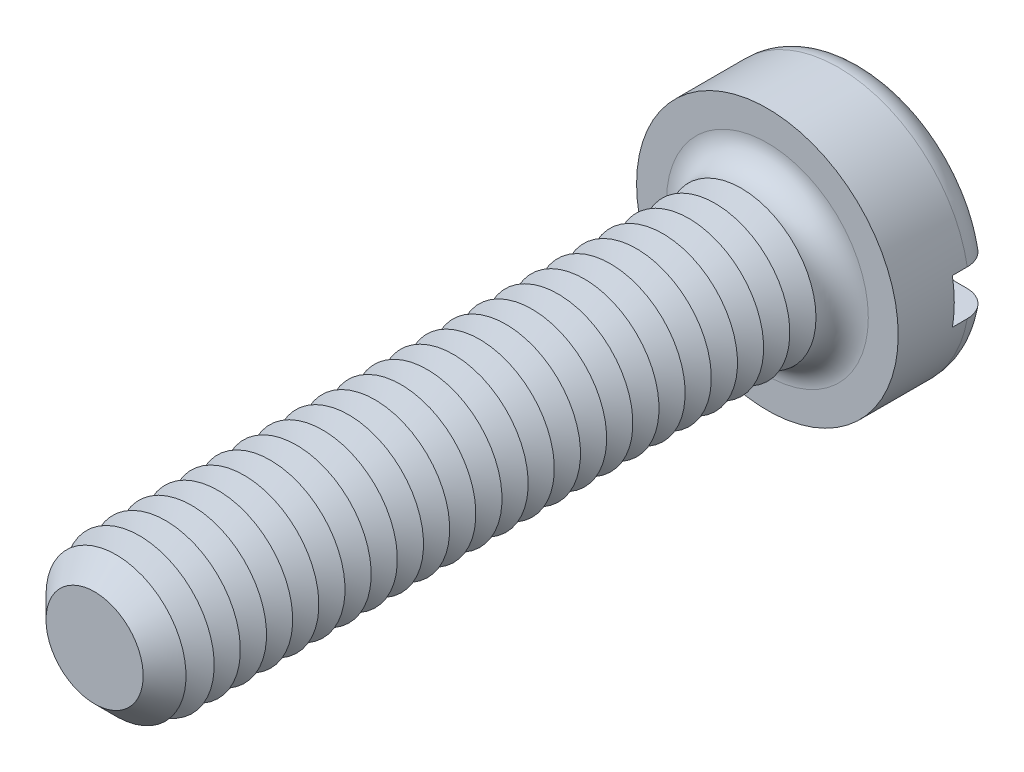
ISO-10303-21;
HEADER;
FILE_DESCRIPTION(('STEP AP214'),'2;1');
FILE_NAME('part.step','',(''),(''),'','','');
FILE_SCHEMA(('AUTOMOTIVE_DESIGN { 1 0 10303 214 1 1 1 1 }'));
ENDSEC;
DATA;
#1=APPLICATION_CONTEXT('core data for automotive mechanical design processes');
#2=APPLICATION_PROTOCOL_DEFINITION('international standard','automotive_design',2000,#1);
#3=PRODUCT_CONTEXT('',#1,'mechanical');
#4=PRODUCT('Part','Part','',(#3));
#5=PRODUCT_RELATED_PRODUCT_CATEGORY('part','',(#4));
#6=PRODUCT_DEFINITION_FORMATION('','',#4);
#7=PRODUCT_DEFINITION_CONTEXT('part definition',#1,'design');
#8=PRODUCT_DEFINITION('design','',#6,#7);
#9=PRODUCT_DEFINITION_SHAPE('','',#8);
#10=(LENGTH_UNIT() NAMED_UNIT(*) SI_UNIT(.MILLI.,.METRE.));
#11=(NAMED_UNIT(*) PLANE_ANGLE_UNIT() SI_UNIT($,.RADIAN.));
#12=(NAMED_UNIT(*) SI_UNIT($,.STERADIAN.) SOLID_ANGLE_UNIT());
#13=UNCERTAINTY_MEASURE_WITH_UNIT(LENGTH_MEASURE(1.E-05),#10,'distance_accuracy_value','');
#14=(GEOMETRIC_REPRESENTATION_CONTEXT(3) GLOBAL_UNCERTAINTY_ASSIGNED_CONTEXT((#13)) GLOBAL_UNIT_ASSIGNED_CONTEXT((#10,
#11,#12)) REPRESENTATION_CONTEXT('',''));
#15=CARTESIAN_POINT('',(0.,0.,0.));
#16=DIRECTION('',(0.,0.,1.));
#17=DIRECTION('',(1.,0.,0.));
#18=AXIS2_PLACEMENT_3D('',#15,#16,#17);
#19=CARTESIAN_POINT('',(0.,0.,-2.6));
#20=DIRECTION('',(0.,0.,1.));
#21=DIRECTION('',(1.,0.,0.));
#22=AXIS2_PLACEMENT_3D('',#19,#20,#21);
#23=PLANE('',#22);
#24=CARTESIAN_POINT('',(0.,0.,-2.6));
#25=DIRECTION('',(0.,0.,1.));
#26=DIRECTION('',(1.,0.,0.));
#27=AXIS2_PLACEMENT_3D('',#24,#25,#26);
#28=CIRCLE('',#27,2.8);
#29=CARTESIAN_POINT('',(-2.73495886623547,0.6,-2.6));
#30=VERTEX_POINT('',#29);
#31=CARTESIAN_POINT('',(2.73495886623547,0.6,-2.6));
#32=VERTEX_POINT('',#31);
#33=EDGE_CURVE('E116',#30,#32,#28,.F.);
#34=ORIENTED_EDGE('',*,*,#33,.T.);
#35=DIRECTION('',(1.,0.,0.));
#36=VECTOR('',#35,1.);
#37=CARTESIAN_POINT('',(-3.5,0.600000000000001,-2.6));
#38=LINE('',#37,#36);
#39=EDGE_CURVE('E111',#30,#32,#38,.T.);
#40=ORIENTED_EDGE('',*,*,#39,.F.);
#41=EDGE_LOOP('',(#34,#40));
#42=FACE_BOUND('',#41,.T.);
#43=ADVANCED_FACE('F39',(#42),#23,.F.);
#44=CARTESIAN_POINT('',(0.,0.,-1.9));
#45=DIRECTION('',(0.,0.,1.));
#46=DIRECTION('',(1.,0.,0.));
#47=AXIS2_PLACEMENT_3D('',#44,#45,#46);
#48=TOROIDAL_SURFACE('',#47,2.8,0.7);
#49=CARTESIAN_POINT('',(-3.24550494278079,0.600000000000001,-2.38938679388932));
#50=CARTESIAN_POINT('',(-3.21724139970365,0.600000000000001,-2.41780774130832));
#51=CARTESIAN_POINT('',(-3.18652103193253,0.600000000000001,-2.44383169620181));
#52=CARTESIAN_POINT('',(-3.12110229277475,0.600000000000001,-2.49034599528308));
#53=CARTESIAN_POINT('',(-3.08639834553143,0.6,-2.51082844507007));
#54=CARTESIAN_POINT('',(-3.01410013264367,0.6,-2.54568075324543));
#55=CARTESIAN_POINT('',(-2.97650963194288,0.6,-2.56005841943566));
#56=CARTESIAN_POINT('',(-2.89948250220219,0.6,-2.58239238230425));
#57=CARTESIAN_POINT('',(-2.86004633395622,0.6,-2.59035027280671));
#58=CARTESIAN_POINT('',(-2.77983715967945,0.6,-2.5997577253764));
#59=CARTESIAN_POINT('',(-2.73905311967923,0.6,-2.60111317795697));
#60=CARTESIAN_POINT('',(-2.65781876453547,0.6,-2.59706866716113));
#61=CARTESIAN_POINT('',(-2.61736849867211,0.6,-2.59166772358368));
#62=CARTESIAN_POINT('',(-2.53729983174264,0.6,-2.57414594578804));
#63=CARTESIAN_POINT('',(-2.49770360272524,0.6,-2.56192363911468));
#64=CARTESIAN_POINT('',(-2.421111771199,0.6,-2.5310238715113));
#65=CARTESIAN_POINT('',(-2.38411632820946,0.6,-2.51234601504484));
#66=CARTESIAN_POINT('',(-2.31371213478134,0.6,-2.46896762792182));
#67=CARTESIAN_POINT('',(-2.28031240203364,0.6,-2.44425244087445));
#68=CARTESIAN_POINT('',(-2.21823311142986,0.6,-2.38946667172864));
#69=CARTESIAN_POINT('',(-2.18955321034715,0.6,-2.35939647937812));
#70=CARTESIAN_POINT('',(-2.13836074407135,0.6,-2.29532787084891));
#71=CARTESIAN_POINT('',(-2.11574147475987,0.6,-2.26141482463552));
#72=CARTESIAN_POINT('',(-2.07677080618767,0.6,-2.19015935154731));
#73=CARTESIAN_POINT('',(-2.06041784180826,0.6,-2.15281778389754));
#74=CARTESIAN_POINT('',(-2.03508596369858,0.6,-2.07723332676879));
#75=CARTESIAN_POINT('',(-2.02585871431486,0.6,-2.03907365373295));
#76=CARTESIAN_POINT('',(-2.01416722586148,0.6,-1.96173417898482));
#77=CARTESIAN_POINT('',(-2.01170151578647,0.6,-1.92255460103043));
#78=CARTESIAN_POINT('',(-2.01359934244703,0.6,-1.84555709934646));
#79=CARTESIAN_POINT('',(-2.01775787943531,0.6,-1.80773393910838));
#80=CARTESIAN_POINT('',(-2.03236373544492,0.6,-1.73332511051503));
#81=CARTESIAN_POINT('',(-2.04281097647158,0.6,-1.69673942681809));
#82=CARTESIAN_POINT('',(-2.06962963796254,0.6,-1.62577336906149));
#83=CARTESIAN_POINT('',(-2.08600685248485,0.6,-1.59139519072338));
#84=CARTESIAN_POINT('',(-2.12413495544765,0.6,-1.52576356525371));
#85=CARTESIAN_POINT('',(-2.14588657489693,0.6,-1.49451054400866));
#86=CARTESIAN_POINT('',(-2.19483541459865,0.6,-1.43498643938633));
#87=CARTESIAN_POINT('',(-2.22217844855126,0.6,-1.40683532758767));
#88=CARTESIAN_POINT('',(-2.28105616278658,0.6,-1.35532544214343));
#89=CARTESIAN_POINT('',(-2.3125916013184,0.6,-1.33196753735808));
#90=CARTESIAN_POINT('',(-2.38018779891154,0.6,-1.28984356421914));
#91=CARTESIAN_POINT('',(-2.41637068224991,0.6,-1.27127330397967));
#92=CARTESIAN_POINT('',(-2.49129688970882,0.6,-1.24032971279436));
#93=CARTESIAN_POINT('',(-2.53004053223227,0.6,-1.22795715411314));
#94=CARTESIAN_POINT('',(-2.6098393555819,0.6,-1.2095515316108));
#95=CARTESIAN_POINT('',(-2.65092550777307,0.6,-1.20365237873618));
#96=CARTESIAN_POINT('',(-2.7335069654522,0.6,-1.1988380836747));
#97=CARTESIAN_POINT('',(-2.7750022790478,0.6,-1.19992308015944));
#98=CARTESIAN_POINT('',(-2.85718851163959,0.6,-1.20909046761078));
#99=CARTESIAN_POINT('',(-2.8978799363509,0.6,-1.21716830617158));
#100=CARTESIAN_POINT('',(-2.97729176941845,0.6,-1.24014327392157));
#101=CARTESIAN_POINT('',(-3.01601231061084,0.6,-1.25503994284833));
#102=CARTESIAN_POINT('',(-3.08976822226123,0.6,-1.29101066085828));
#103=CARTESIAN_POINT('',(-3.12484927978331,0.600000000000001,-1.31199098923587));
#104=CARTESIAN_POINT('',(-3.19090022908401,0.600000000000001,-1.35965144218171));
#105=CARTESIAN_POINT('',(-3.22187053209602,0.600000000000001,-1.38633099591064));
#106=CARTESIAN_POINT('',(-3.2781946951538,0.600000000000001,-1.44408564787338));
#107=CARTESIAN_POINT('',(-3.3036441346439,0.600000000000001,-1.47506754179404));
#108=CARTESIAN_POINT('',(-3.34887649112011,0.600000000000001,-1.54092398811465));
#109=CARTESIAN_POINT('',(-3.36865993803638,0.600000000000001,-1.57579817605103));
#110=CARTESIAN_POINT('',(-3.40166738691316,0.600000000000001,-1.64783067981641));
#111=CARTESIAN_POINT('',(-3.41499360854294,0.600000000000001,-1.68494217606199));
#112=CARTESIAN_POINT('',(-3.43515375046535,0.600000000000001,-1.76088675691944));
#113=CARTESIAN_POINT('',(-3.44198836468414,0.600000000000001,-1.79971965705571));
#114=CARTESIAN_POINT('',(-3.44891916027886,0.600000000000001,-1.87757893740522));
#115=CARTESIAN_POINT('',(-3.44908375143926,0.600000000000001,-1.91659924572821));
#116=CARTESIAN_POINT('',(-3.44284111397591,0.600000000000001,-1.99412088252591));
#117=CARTESIAN_POINT('',(-3.43643236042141,0.600000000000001,-2.03262208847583));
#118=CARTESIAN_POINT('',(-3.41725803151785,0.600000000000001,-2.10792315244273));
#119=CARTESIAN_POINT('',(-3.40450469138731,0.600000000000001,-2.14472613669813));
#120=CARTESIAN_POINT('',(-3.3730385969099,0.600000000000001,-2.21565060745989));
#121=CARTESIAN_POINT('',(-3.35433321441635,0.600000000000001,-2.24977534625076));
#122=CARTESIAN_POINT('',(-3.3201892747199,0.600000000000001,-2.30136364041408));
#123=CARTESIAN_POINT('',(-3.30647805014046,0.600000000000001,-2.31999402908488));
#124=CARTESIAN_POINT('',(-3.27728518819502,0.600000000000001,-2.35581090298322));
#125=CARTESIAN_POINT('',(-3.26180356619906,0.600000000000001,-2.37299740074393));
#126=CARTESIAN_POINT('',(-3.24550494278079,0.600000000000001,-2.38938679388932));
#127=B_SPLINE_CURVE_WITH_KNOTS('',3,(#49,#50,#51,#52,#53,#54,#55,#56,#57,#58,#59,#60,#61,#62,
#63,#64,#65,#66,#67,#68,#69,#70,#71,#72,#73,#74,#75,#76,#77,#78,#79,#80,#81,#82,#83,#84,#85,#86,
#87,#88,#89,#90,#91,#92,#93,#94,#95,#96,#97,#98,#99,#100,#101,#102,#103,#104,#105,#106,#107,
#108,#109,#110,#111,#112,#113,#114,#115,#116,#117,#118,#119,#120,#121,#122,#123,#124,#125,#126),
.UNSPECIFIED.,.T.,.F.,(4,2,2,2,2,2,2,2,2,2,2,2,2,2,2,2,2,2,2,2,2,2,2,2,2,2,2,2,2,2,2,2,2,2,2,2,
2,2,4),(0.,0.120160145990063,0.240490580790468,0.36066665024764,0.480812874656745,
0.602666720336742,0.724538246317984,0.848272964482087,0.972015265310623,1.09606100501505,
1.2200977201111,1.34178071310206,1.46343329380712,1.58062647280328,1.6977941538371,
1.81140573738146,1.92501591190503,2.03873739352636,2.15247435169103,2.26967910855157,
2.38690509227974,2.50835551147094,2.62982106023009,2.75375450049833,2.87769040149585,
3.00154567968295,3.12539259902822,3.24742469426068,3.36944457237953,3.48914477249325,
3.60883377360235,3.72656056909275,3.84427477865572,3.96078136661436,4.07731498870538,
4.19362474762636,4.3097910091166,4.37908387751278,4.44837614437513),.UNSPECIFIED.);
#128=CARTESIAN_POINT('',(-3.44818792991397,0.600000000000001,-1.8999999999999));
#129=VERTEX_POINT('',#128);
#130=EDGE_CURVE('E377',#129,#30,#127,.T.);
#131=ORIENTED_EDGE('',*,*,#130,.F.);
#132=CARTESIAN_POINT('',(0.,0.,-1.9));
#133=DIRECTION('',(0.,0.,1.));
#134=DIRECTION('',(1.,0.,0.));
#135=AXIS2_PLACEMENT_3D('',#132,#133,#134);
#136=CIRCLE('',#135,3.5);
#137=CARTESIAN_POINT('',(3.44818792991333,0.6,-1.9));
#138=VERTEX_POINT('',#137);
#139=EDGE_CURVE('E125',#138,#129,#136,.T.);
#140=ORIENTED_EDGE('',*,*,#139,.F.);
#141=CARTESIAN_POINT('',(2.1414268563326,0.6,-2.29762171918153));
#142=CARTESIAN_POINT('',(2.16505443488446,0.6,-2.33058245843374));
#143=CARTESIAN_POINT('',(2.19155609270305,0.6,-2.36152717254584));
#144=CARTESIAN_POINT('',(2.24942944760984,0.6,-2.41852964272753));
#145=CARTESIAN_POINT('',(2.28080921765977,0.6,-2.44457913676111));
#146=CARTESIAN_POINT('',(2.34741203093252,0.6,-2.49105381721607));
#147=CARTESIAN_POINT('',(2.38262862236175,0.6,-2.51148824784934));
#148=CARTESIAN_POINT('',(2.45593176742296,0.6,-2.54626881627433));
#149=CARTESIAN_POINT('',(2.49401741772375,0.6,-2.56061686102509));
#150=CARTESIAN_POINT('',(2.57272605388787,0.6,-2.58306429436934));
#151=CARTESIAN_POINT('',(2.6133821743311,0.6,-2.59104769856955));
#152=CARTESIAN_POINT('',(2.6954618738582,0.6,-2.60009608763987));
#153=CARTESIAN_POINT('',(2.73688552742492,0.6,-2.60116039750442));
#154=CARTESIAN_POINT('',(2.81941950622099,0.6,-2.5962925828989));
#155=CARTESIAN_POINT('',(2.86052888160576,0.6,-2.59034422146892));
#156=CARTESIAN_POINT('',(2.94113709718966,0.6,-2.57153687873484));
#157=CARTESIAN_POINT('',(2.98063603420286,0.6,-2.55867831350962));
#158=CARTESIAN_POINT('',(3.05633735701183,0.6,-2.52657771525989));
#159=CARTESIAN_POINT('',(3.09257627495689,0.6,-2.50742188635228));
#160=CARTESIAN_POINT('',(3.16123898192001,0.6,-2.46318606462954));
#161=CARTESIAN_POINT('',(3.19366316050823,0.6,-2.4381066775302));
#162=CARTESIAN_POINT('',(3.25312278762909,0.6,-2.38324481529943));
#163=CARTESIAN_POINT('',(3.28024842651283,0.6,-2.35356008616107));
#164=CARTESIAN_POINT('',(3.32902587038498,0.6,-2.28998971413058));
#165=CARTESIAN_POINT('',(3.35067820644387,0.6,-2.25610447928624));
#166=CARTESIAN_POINT('',(3.38751207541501,0.6,-2.18572286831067));
#167=CARTESIAN_POINT('',(3.40279804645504,0.6,-2.14928112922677));
#168=CARTESIAN_POINT('',(3.42695590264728,0.6,-2.07433042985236));
#169=CARTESIAN_POINT('',(3.43582824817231,0.6,-2.03582161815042));
#170=CARTESIAN_POINT('',(3.44682113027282,0.6,-1.95829536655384));
#171=CARTESIAN_POINT('',(3.44901648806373,0.6,-1.91928851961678));
#172=CARTESIAN_POINT('',(3.44680085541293,0.6,-1.84146366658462));
#173=CARTESIAN_POINT('',(3.44239008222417,0.6,-1.80264565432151));
#174=CARTESIAN_POINT('',(3.42712544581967,0.6,-1.72644634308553));
#175=CARTESIAN_POINT('',(3.41629508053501,0.6,-1.6890603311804));
#176=CARTESIAN_POINT('',(3.38853757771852,0.6,-1.61662604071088));
#177=CARTESIAN_POINT('',(3.37161039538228,0.6,-1.58157777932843));
#178=CARTESIAN_POINT('',(3.33207798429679,0.6,-1.51464178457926));
#179=CARTESIAN_POINT('',(3.30944854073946,0.6,-1.48276835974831));
#180=CARTESIAN_POINT('',(3.2592165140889,0.6,-1.42321861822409));
#181=CARTESIAN_POINT('',(3.23161370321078,0.6,-1.3955424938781));
#182=CARTESIAN_POINT('',(3.17188519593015,0.6,-1.34481834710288));
#183=CARTESIAN_POINT('',(3.13971065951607,0.6,-1.32182785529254));
#184=CARTESIAN_POINT('',(3.07201123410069,0.6,-1.28147003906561));
#185=CARTESIAN_POINT('',(3.03648608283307,0.6,-1.26410315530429));
#186=CARTESIAN_POINT('',(2.962449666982,0.6,-1.2351645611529));
#187=CARTESIAN_POINT('',(2.92389781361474,0.6,-1.22369671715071));
#188=CARTESIAN_POINT('',(2.84543273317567,0.6,-1.20726565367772));
#189=CARTESIAN_POINT('',(2.80551936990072,0.6,-1.20230308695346));
#190=CARTESIAN_POINT('',(2.72467191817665,0.6,-1.1989357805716));
#191=CARTESIAN_POINT('',(2.68373266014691,0.6,-1.20065484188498));
#192=CARTESIAN_POINT('',(2.60270222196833,0.6,-1.21084560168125));
#193=CARTESIAN_POINT('',(2.56261112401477,0.6,-1.21931795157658));
#194=CARTESIAN_POINT('',(2.48385954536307,0.6,-1.24292934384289));
#195=CARTESIAN_POINT('',(2.44522508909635,0.6,-1.25815531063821));
#196=CARTESIAN_POINT('',(2.37106165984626,0.6,-1.29488663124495));
#197=CARTESIAN_POINT('',(2.33553282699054,0.6,-1.31639226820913));
#198=CARTESIAN_POINT('',(2.2686996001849,0.6,-1.36507949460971));
#199=CARTESIAN_POINT('',(2.23738745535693,0.6,-1.39225042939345));
#200=CARTESIAN_POINT('',(2.17990424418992,0.6,-1.45157941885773));
#201=CARTESIAN_POINT('',(2.15373259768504,0.6,-1.48373691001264));
#202=CARTESIAN_POINT('',(2.10799355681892,0.6,-1.551327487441));
#203=CARTESIAN_POINT('',(2.08828258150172,0.6,-1.58666329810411));
#204=CARTESIAN_POINT('',(2.05534440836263,0.6,-1.66023600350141));
#205=CARTESIAN_POINT('',(2.042115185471,0.6,-1.6984719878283));
#206=CARTESIAN_POINT('',(2.02303126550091,0.6,-1.77519783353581));
#207=CARTESIAN_POINT('',(2.01691541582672,0.6,-1.8136228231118));
#208=CARTESIAN_POINT('',(2.01140375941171,0.6,-1.89096056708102));
#209=CARTESIAN_POINT('',(2.01200856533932,0.6,-1.92987336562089));
#210=CARTESIAN_POINT('',(2.01981617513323,0.6,-2.006065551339));
#211=CARTESIAN_POINT('',(2.02685835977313,0.6,-2.04336165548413));
#212=CARTESIAN_POINT('',(2.0470502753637,0.6,-2.1162250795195));
#213=CARTESIAN_POINT('',(2.06019252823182,0.6,-2.15179445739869));
#214=CARTESIAN_POINT('',(2.08525738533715,0.6,-2.20558874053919));
#215=CARTESIAN_POINT('',(2.09529161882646,0.6,-2.22471751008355));
#216=CARTESIAN_POINT('',(2.11708813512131,0.6,-2.26196179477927));
#217=CARTESIAN_POINT('',(2.12885034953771,0.6,-2.28007734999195));
#218=CARTESIAN_POINT('',(2.1414268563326,0.6,-2.29762171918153));
#219=B_SPLINE_CURVE_WITH_KNOTS('',3,(#141,#142,#143,#144,#145,#146,#147,#148,#149,#150,#151,
#152,#153,#154,#155,#156,#157,#158,#159,#160,#161,#162,#163,#164,#165,#166,#167,#168,#169,#170,
#171,#172,#173,#174,#175,#176,#177,#178,#179,#180,#181,#182,#183,#184,#185,#186,#187,#188,#189,
#190,#191,#192,#193,#194,#195,#196,#197,#198,#199,#200,#201,#202,#203,#204,#205,#206,#207,#208,
#209,#210,#211,#212,#213,#214,#215,#216,#217,#218),.UNSPECIFIED.,.T.,.F.,(4,2,2,2,2,2,2,2,2,2,2,
2,2,2,2,2,2,2,2,2,2,2,2,2,2,2,2,2,2,2,2,2,2,2,2,2,2,2,4),(0.,0.121582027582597,
0.243367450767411,0.364951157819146,0.486496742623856,0.610209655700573,0.733934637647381,
0.857946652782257,0.981951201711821,1.1043243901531,1.22668507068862,1.34673532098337,
1.46677391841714,1.58475736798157,1.70273234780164,1.81938035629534,1.93602452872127,
2.05224435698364,2.168465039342,2.28518782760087,2.40191596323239,2.52000081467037,
2.63809491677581,2.75820270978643,2.87832255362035,3.00067856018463,3.1230463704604,
3.24703703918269,3.37103329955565,3.49479843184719,3.6185495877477,3.73932715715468,
3.86006696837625,3.9762182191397,4.09238005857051,4.2057203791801,4.31892212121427,
4.38364046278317,4.44835624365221),.UNSPECIFIED.);
#220=EDGE_CURVE('E379',#32,#138,#219,.T.);
#221=ORIENTED_EDGE('',*,*,#220,.F.);
#222=ORIENTED_EDGE('',*,*,#33,.F.);
#223=EDGE_LOOP('',(#131,#140,#221,#222));
#224=FACE_BOUND('',#223,.T.);
#225=ADVANCED_FACE('F361',(#224),#48,.T.);
#226=CARTESIAN_POINT('',(0.,0.,-2.6));
#227=DIRECTION('',(0.,0.,1.));
#228=DIRECTION('',(1.,0.,0.));
#229=AXIS2_PLACEMENT_3D('',#226,#227,#228);
#230=CYLINDRICAL_SURFACE('',#229,3.5);
#231=DIRECTION('',(0.,0.,1.));
#232=VECTOR('',#231,1.);
#233=CARTESIAN_POINT('',(3.44818792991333,0.6,-2.6));
#234=LINE('',#233,#232);
#235=CARTESIAN_POINT('',(3.44818792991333,0.6,-1.5));
#236=VERTEX_POINT('',#235);
#237=EDGE_CURVE('E395',#138,#236,#234,.T.);
#238=ORIENTED_EDGE('',*,*,#237,.F.);
#239=ORIENTED_EDGE('',*,*,#139,.T.);
#240=DIRECTION('',(0.,0.,1.));
#241=VECTOR('',#240,1.);
#242=CARTESIAN_POINT('',(-3.44818792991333,0.600000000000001,-2.6));
#243=LINE('',#242,#241);
#244=CARTESIAN_POINT('',(-3.44818792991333,0.600000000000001,-1.5));
#245=VERTEX_POINT('',#244);
#246=EDGE_CURVE('E63',#245,#129,#243,.F.);
#247=ORIENTED_EDGE('',*,*,#246,.F.);
#248=CARTESIAN_POINT('',(0.,0.,-1.5));
#249=DIRECTION('',(0.,0.,-1.));
#250=DIRECTION('',(-1.,0.,0.));
#251=AXIS2_PLACEMENT_3D('',#248,#249,#250);
#252=CIRCLE('',#251,3.5);
#253=CARTESIAN_POINT('',(-3.44818792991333,-0.599999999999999,-1.5));
#254=VERTEX_POINT('',#253);
#255=EDGE_CURVE('E43',#245,#254,#252,.F.);
#256=ORIENTED_EDGE('',*,*,#255,.T.);
#257=DIRECTION('',(0.,0.,1.));
#258=VECTOR('',#257,1.);
#259=CARTESIAN_POINT('',(-3.44818792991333,-0.599999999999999,-2.6));
#260=LINE('',#259,#258);
#261=CARTESIAN_POINT('',(-3.44818792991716,-0.599999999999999,-1.90000000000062));
#262=VERTEX_POINT('',#261);
#263=EDGE_CURVE('E392',#262,#254,#260,.T.);
#264=ORIENTED_EDGE('',*,*,#263,.F.);
#265=CARTESIAN_POINT('',(3.44818792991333,-0.6,-1.9));
#266=VERTEX_POINT('',#265);
#267=EDGE_CURVE('E127',#262,#266,#136,.T.);
#268=ORIENTED_EDGE('',*,*,#267,.T.);
#269=DIRECTION('',(0.,0.,1.));
#270=VECTOR('',#269,1.);
#271=CARTESIAN_POINT('',(3.44818792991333,-0.6,-2.6));
#272=LINE('',#271,#270);
#273=CARTESIAN_POINT('',(3.44818792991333,-0.6,-1.5));
#274=VERTEX_POINT('',#273);
#275=EDGE_CURVE('E55',#274,#266,#272,.F.);
#276=ORIENTED_EDGE('',*,*,#275,.F.);
#277=EDGE_CURVE('E11',#274,#236,#252,.F.);
#278=ORIENTED_EDGE('',*,*,#277,.T.);
#279=EDGE_LOOP('',(#238,#239,#247,#256,#264,#268,#276,#278));
#280=FACE_BOUND('',#279,.T.);
#281=CARTESIAN_POINT('',(0.,0.,0.));
#282=DIRECTION('',(0.,0.,1.));
#283=DIRECTION('',(1.,0.,0.));
#284=AXIS2_PLACEMENT_3D('',#281,#282,#283);
#285=CIRCLE('',#284,3.5);
#286=CARTESIAN_POINT('',(3.5,0.,0.));
#287=VERTEX_POINT('',#286);
#288=EDGE_CURVE('E398',#287,#287,#285,.T.);
#289=ORIENTED_EDGE('',*,*,#288,.F.);
#290=EDGE_LOOP('',(#289));
#291=FACE_BOUND('',#290,.T.);
#292=ADVANCED_FACE('F357',(#280,#291),#230,.T.);
#293=CARTESIAN_POINT('',(2.73495886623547,-0.6,-2.6));
#294=VERTEX_POINT('',#293);
#295=CARTESIAN_POINT('',(-2.73495886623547,-0.6,-2.6));
#296=VERTEX_POINT('',#295);
#297=EDGE_CURVE('E109',#294,#296,#28,.F.);
#298=ORIENTED_EDGE('',*,*,#297,.T.);
#299=DIRECTION('',(-1.,0.,0.));
#300=VECTOR('',#299,1.);
#301=CARTESIAN_POINT('',(-3.5,-0.599999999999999,-2.6));
#302=LINE('',#301,#300);
#303=EDGE_CURVE('E96',#294,#296,#302,.T.);
#304=ORIENTED_EDGE('',*,*,#303,.F.);
#305=EDGE_LOOP('',(#298,#304));
#306=FACE_BOUND('',#305,.T.);
#307=ADVANCED_FACE('F108',(#306),#23,.F.);
#308=CARTESIAN_POINT('',(0.,0.,0.));
#309=DIRECTION('',(0.,0.,1.));
#310=DIRECTION('',(1.,0.,0.));
#311=AXIS2_PLACEMENT_3D('',#308,#309,#310);
#312=PLANE('',#311);
#313=CARTESIAN_POINT('',(0.,0.,0.));
#314=DIRECTION('',(0.,0.,1.));
#315=DIRECTION('',(1.,0.,0.));
#316=AXIS2_PLACEMENT_3D('',#313,#314,#315);
#317=CIRCLE('',#316,2.7);
#318=CARTESIAN_POINT('',(2.7,0.,0.));
#319=VERTEX_POINT('',#318);
#320=EDGE_CURVE('E115',#319,#319,#317,.F.);
#321=ORIENTED_EDGE('',*,*,#320,.T.);
#322=EDGE_LOOP('',(#321));
#323=FACE_BOUND('',#322,.T.);
#324=ORIENTED_EDGE('',*,*,#288,.T.);
#325=EDGE_LOOP('',(#324));
#326=FACE_BOUND('',#325,.T.);
#327=ADVANCED_FACE('F356',(#323,#326),#312,.T.);
#328=CARTESIAN_POINT('',(-3.24550494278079,-0.599999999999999,-2.38938679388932));
#329=CARTESIAN_POINT('',(-3.27309693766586,-0.599999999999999,-2.36163611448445));
#330=CARTESIAN_POINT('',(-3.29838741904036,-0.599999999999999,-2.3315608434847));
#331=CARTESIAN_POINT('',(-3.34359429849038,-0.599999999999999,-2.26757659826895));
#332=CARTESIAN_POINT('',(-3.36350518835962,-0.599999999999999,-2.23366374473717));
#333=CARTESIAN_POINT('',(-3.39733065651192,-0.599999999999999,-2.16296274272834));
#334=CARTESIAN_POINT('',(-3.4112451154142,-0.599999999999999,-2.12617453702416));
#335=CARTESIAN_POINT('',(-3.43264462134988,-0.599999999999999,-2.05078178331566));
#336=CARTESIAN_POINT('',(-3.44013114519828,-0.599999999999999,-2.01217765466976));
#337=CARTESIAN_POINT('',(-3.44841975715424,-0.599999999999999,-1.9345391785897));
#338=CARTESIAN_POINT('',(-3.44926944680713,-0.599999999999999,-1.89550990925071));
#339=CARTESIAN_POINT('',(-3.44438358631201,-0.599999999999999,-1.81786552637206));
#340=CARTESIAN_POINT('',(-3.43864801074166,-0.599999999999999,-1.77925041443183));
#341=CARTESIAN_POINT('',(-3.42079221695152,-0.599999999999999,-1.70364264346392));
#342=CARTESIAN_POINT('',(-3.40869011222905,-0.599999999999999,-1.66664570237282));
#343=CARTESIAN_POINT('',(-3.37847692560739,-0.599999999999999,-1.59519424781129));
#344=CARTESIAN_POINT('',(-3.3603657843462,-0.599999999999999,-1.56073975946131));
#345=CARTESIAN_POINT('',(-3.31856549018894,-0.599999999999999,-1.4951524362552));
#346=CARTESIAN_POINT('',(-3.29484830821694,-0.599999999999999,-1.46403747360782));
#347=CARTESIAN_POINT('',(-3.24258489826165,-0.599999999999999,-1.40617131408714));
#348=CARTESIAN_POINT('',(-3.21403843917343,-0.599999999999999,-1.37942032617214));
#349=CARTESIAN_POINT('',(-3.15256084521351,-0.599999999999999,-1.33067963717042));
#350=CARTESIAN_POINT('',(-3.11958015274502,-0.599999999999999,-1.30875246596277));
#351=CARTESIAN_POINT('',(-3.0504559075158,-0.599999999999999,-1.27063718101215));
#352=CARTESIAN_POINT('',(-3.01431209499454,-0.6,-1.25444953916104));
#353=CARTESIAN_POINT('',(-2.93921710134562,-0.6,-1.22796796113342));
#354=CARTESIAN_POINT('',(-2.90022796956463,-0.6,-1.217781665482));
#355=CARTESIAN_POINT('',(-2.82110512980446,-0.6,-1.20396915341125));
#356=CARTESIAN_POINT('',(-2.7809713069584,-0.6,-1.2003435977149));
#357=CARTESIAN_POINT('',(-2.69990924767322,-0.6,-1.19969717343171));
#358=CARTESIAN_POINT('',(-2.65898001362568,-0.6,-1.20279937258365));
#359=CARTESIAN_POINT('',(-2.57819986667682,-0.6,-1.21574287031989));
#360=CARTESIAN_POINT('',(-2.53834905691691,-0.6,-1.22558481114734));
#361=CARTESIAN_POINT('',(-2.46035232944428,-0.6,-1.25189361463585));
#362=CARTESIAN_POINT('',(-2.42223314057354,-0.6,-1.2684398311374));
#363=CARTESIAN_POINT('',(-2.34932316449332,-0.6,-1.30771928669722));
#364=CARTESIAN_POINT('',(-2.31453248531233,-0.6,-1.33045272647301));
#365=CARTESIAN_POINT('',(-2.24945577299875,-0.6,-1.38141543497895));
#366=CARTESIAN_POINT('',(-2.21915255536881,-0.6,-1.40962272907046));
#367=CARTESIAN_POINT('',(-2.16386461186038,-0.6,-1.47084552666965));
#368=CARTESIAN_POINT('',(-2.13887916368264,-0.6,-1.50386037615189));
#369=CARTESIAN_POINT('',(-2.09568071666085,-0.6,-1.57285917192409));
#370=CARTESIAN_POINT('',(-2.07730739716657,-0.6,-1.60874263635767));
#371=CARTESIAN_POINT('',(-2.04712019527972,-0.6,-1.68316975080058));
#372=CARTESIAN_POINT('',(-2.03530452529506,-0.6,-1.72171267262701));
#373=CARTESIAN_POINT('',(-2.01901751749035,-0.6,-1.79878952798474));
#374=CARTESIAN_POINT('',(-2.01428434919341,-0.6,-1.8372682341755));
#375=CARTESIAN_POINT('',(-2.01150652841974,-0.6,-1.91446369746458));
#376=CARTESIAN_POINT('',(-2.01346084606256,-0.6,-1.95318041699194));
#377=CARTESIAN_POINT('',(-2.02386268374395,-0.6,-2.0288619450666));
#378=CARTESIAN_POINT('',(-2.03216724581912,-0.6,-2.06584654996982));
#379=CARTESIAN_POINT('',(-2.05479337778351,-0.6,-2.13792373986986));
#380=CARTESIAN_POINT('',(-2.06911522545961,-0.6,-2.1730162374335));
#381=CARTESIAN_POINT('',(-2.10349906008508,-0.6,-2.24081034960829));
#382=CARTESIAN_POINT('',(-2.12363007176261,-0.6,-2.27347689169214));
#383=CARTESIAN_POINT('',(-2.16891308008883,-0.6,-2.33511902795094));
#384=CARTESIAN_POINT('',(-2.19406590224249,-0.6,-2.36409401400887));
#385=CARTESIAN_POINT('',(-2.24962389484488,-0.6,-2.41861972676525));
#386=CARTESIAN_POINT('',(-2.28018314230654,-0.6,-2.44401345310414));
#387=CARTESIAN_POINT('',(-2.34501720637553,-0.6,-2.48950558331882));
#388=CARTESIAN_POINT('',(-2.37929266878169,-0.6,-2.50960306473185));
#389=CARTESIAN_POINT('',(-2.45179417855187,-0.6,-2.54458276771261));
#390=CARTESIAN_POINT('',(-2.49011248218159,-0.6,-2.55927401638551));
#391=CARTESIAN_POINT('',(-2.56865227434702,-0.6,-2.58211133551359));
#392=CARTESIAN_POINT('',(-2.60887386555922,-0.6,-2.59025705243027));
#393=CARTESIAN_POINT('',(-2.69064746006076,-0.6,-2.59982905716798));
#394=CARTESIAN_POINT('',(-2.73220999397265,-0.6,-2.60116580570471));
#395=CARTESIAN_POINT('',(-2.81497658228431,-0.6,-2.59679700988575));
#396=CARTESIAN_POINT('',(-2.85618055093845,-0.6,-2.59108982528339));
#397=CARTESIAN_POINT('',(-2.93677683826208,-0.6,-2.57279487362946));
#398=CARTESIAN_POINT('',(-2.97617834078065,-0.6,-2.56024753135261));
#399=CARTESIAN_POINT('',(-3.05222242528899,-0.6,-2.52860709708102));
#400=CARTESIAN_POINT('',(-3.08886850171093,-0.599999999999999,-2.50952247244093));
#401=CARTESIAN_POINT('',(-3.14562501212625,-0.599999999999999,-2.47340693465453));
#402=CARTESIAN_POINT('',(-3.16689358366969,-0.599999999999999,-2.45816337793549));
#403=CARTESIAN_POINT('',(-3.20761866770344,-0.599999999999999,-2.42542115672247));
#404=CARTESIAN_POINT('',(-3.22707520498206,-0.599999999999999,-2.40792252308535));
#405=CARTESIAN_POINT('',(-3.24550494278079,-0.599999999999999,-2.38938679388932));
#406=B_SPLINE_CURVE_WITH_KNOTS('',3,(#328,#329,#330,#331,#332,#333,#334,#335,#336,#337,#338,
#339,#340,#341,#342,#343,#344,#345,#346,#347,#348,#349,#350,#351,#352,#353,#354,#355,#356,#357,
#358,#359,#360,#361,#362,#363,#364,#365,#366,#367,#368,#369,#370,#371,#372,#373,#374,#375,#376,
#377,#378,#379,#380,#381,#382,#383,#384,#385,#386,#387,#388,#389,#390,#391,#392,#393,#394,#395,
#396,#397,#398,#399,#400,#401,#402,#403,#404,#405),.UNSPECIFIED.,.T.,.F.,(4,2,2,2,2,2,2,2,2,2,2,
2,2,2,2,2,2,2,2,2,2,2,2,2,2,2,2,2,2,2,2,2,2,2,2,2,2,2,4),(0.,0.117306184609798,
0.234732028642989,0.352160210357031,0.469561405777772,0.586119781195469,0.702678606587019,
0.818907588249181,0.935137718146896,1.05196174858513,1.1687913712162,1.2870562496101,
1.40533084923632,1.52566688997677,1.64601504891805,1.76858322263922,1.89116307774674,
2.01523830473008,2.13931755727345,2.26290863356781,2.38648291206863,2.50681878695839,
2.62712184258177,2.74285697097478,2.85857427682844,2.97176054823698,3.08495204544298,
3.19954814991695,3.31416310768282,3.43282436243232,3.55150627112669,3.67404987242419,
3.79660009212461,3.92075778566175,4.04494439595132,4.16840490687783,4.29170610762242,
4.3700604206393,4.44841366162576),.UNSPECIFIED.);
#407=EDGE_CURVE('E103',#296,#262,#406,.T.);
#408=ORIENTED_EDGE('',*,*,#407,.F.);
#409=ORIENTED_EDGE('',*,*,#297,.F.);
#410=CARTESIAN_POINT('',(2.1414268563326,-0.6,-2.29762171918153));
#411=CARTESIAN_POINT('',(2.11900044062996,-0.6,-2.26633119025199));
#412=CARTESIAN_POINT('',(2.09913154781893,-0.6,-2.23318080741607));
#413=CARTESIAN_POINT('',(2.06517900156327,-0.6,-2.16401111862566));
#414=CARTESIAN_POINT('',(2.05109968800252,-0.6,-2.12798968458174));
#415=CARTESIAN_POINT('',(2.02923593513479,-0.6,-2.05404277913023));
#416=CARTESIAN_POINT('',(2.02145692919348,-0.6,-2.01611569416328));
#417=CARTESIAN_POINT('',(2.01251710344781,-0.6,-1.93949649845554));
#418=CARTESIAN_POINT('',(2.01135461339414,-0.6,-1.90080458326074));
#419=CARTESIAN_POINT('',(2.01564803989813,-0.6,-1.82450508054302));
#420=CARTESIAN_POINT('',(2.02098305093,-0.6,-1.78689061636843));
#421=CARTESIAN_POINT('',(2.03786826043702,-0.6,-1.71308589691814));
#422=CARTESIAN_POINT('',(2.04941870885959,-0.6,-1.67689569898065));
#423=CARTESIAN_POINT('',(2.07838664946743,-0.6,-1.60676639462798));
#424=CARTESIAN_POINT('',(2.09582944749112,-0.6,-1.57283776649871));
#425=CARTESIAN_POINT('',(2.1359925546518,-0.6,-1.50826612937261));
#426=CARTESIAN_POINT('',(2.15871360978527,-0.6,-1.47762358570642));
#427=CARTESIAN_POINT('',(2.20955413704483,-0.6,-1.41943384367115));
#428=CARTESIAN_POINT('',(2.23782364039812,-0.6,-1.39201777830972));
#429=CARTESIAN_POINT('',(2.29842612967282,-0.6,-1.34212199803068));
#430=CARTESIAN_POINT('',(2.33075984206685,-0.6,-1.31964316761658));
#431=CARTESIAN_POINT('',(2.399806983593,-0.6,-1.27945238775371));
#432=CARTESIAN_POINT('',(2.43663466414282,-0.6,-1.26193653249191));
#433=CARTESIAN_POINT('',(2.51267241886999,-0.6,-1.23320660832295));
#434=CARTESIAN_POINT('',(2.55188277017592,-0.6,-1.22199327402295));
#435=CARTESIAN_POINT('',(2.63235000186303,-0.6,-1.20602688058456));
#436=CARTESIAN_POINT('',(2.673631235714,-0.6,-1.20139617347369));
#437=CARTESIAN_POINT('',(2.7563863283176,-0.6,-1.19914622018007));
#438=CARTESIAN_POINT('',(2.79786018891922,-0.6,-1.20152704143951));
#439=CARTESIAN_POINT('',(2.87971192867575,-0.6,-1.21326884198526));
#440=CARTESIAN_POINT('',(2.92009214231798,-0.6,-1.22261349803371));
#441=CARTESIAN_POINT('',(2.99866777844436,-0.6,-1.24805614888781));
#442=CARTESIAN_POINT('',(3.03686335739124,-0.6,-1.26415365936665));
#443=CARTESIAN_POINT('',(3.10934738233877,-0.6,-1.3023912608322));
#444=CARTESIAN_POINT('',(3.14368704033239,-0.6,-1.32443423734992));
#445=CARTESIAN_POINT('',(3.20808395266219,-0.6,-1.37407725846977));
#446=CARTESIAN_POINT('',(3.23814164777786,-0.6,-1.40167673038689));
#447=CARTESIAN_POINT('',(3.29251534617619,-0.6,-1.46108303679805));
#448=CARTESIAN_POINT('',(3.3169296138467,-0.6,-1.49279994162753));
#449=CARTESIAN_POINT('',(3.35998418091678,-0.6,-1.55993706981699));
#450=CARTESIAN_POINT('',(3.37862502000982,-0.6,-1.59535694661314));
#451=CARTESIAN_POINT('',(3.40930212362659,-0.6,-1.668283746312));
#452=CARTESIAN_POINT('',(3.42143897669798,-0.6,-1.70574837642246));
#453=CARTESIAN_POINT('',(3.43918305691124,-0.6,-1.78219297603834));
#454=CARTESIAN_POINT('',(3.44479069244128,-0.6,-1.82117285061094));
#455=CARTESIAN_POINT('',(3.44928173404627,-0.6,-1.89914596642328));
#456=CARTESIAN_POINT('',(3.44822835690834,-0.6,-1.93813558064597));
#457=CARTESIAN_POINT('',(3.43957811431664,-0.6,-2.0153811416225));
#458=CARTESIAN_POINT('',(3.43198139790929,-0.6,-2.05363710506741));
#459=CARTESIAN_POINT('',(3.41049386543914,-0.6,-2.12826741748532));
#460=CARTESIAN_POINT('',(3.39661362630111,-0.6,-2.16464481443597));
#461=CARTESIAN_POINT('',(3.36297924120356,-0.6,-2.23457274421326));
#462=CARTESIAN_POINT('',(3.34322499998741,-0.6,-2.26812323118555));
#463=CARTESIAN_POINT('',(3.29828706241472,-0.6,-2.33167864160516));
#464=CARTESIAN_POINT('',(3.27307040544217,-0.6,-2.36166024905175));
#465=CARTESIAN_POINT('',(3.21802069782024,-0.6,-2.41703165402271));
#466=CARTESIAN_POINT('',(3.18818738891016,-0.6,-2.44242119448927));
#467=CARTESIAN_POINT('',(3.12433871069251,-0.6,-2.48825551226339));
#468=CARTESIAN_POINT('',(3.09027338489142,-0.6,-2.50863067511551));
#469=CARTESIAN_POINT('',(3.01925175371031,-0.6,-2.54348754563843));
#470=CARTESIAN_POINT('',(2.982295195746,-0.6,-2.55796873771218));
#471=CARTESIAN_POINT('',(2.90583499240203,-0.6,-2.58090526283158));
#472=CARTESIAN_POINT('',(2.86629758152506,-0.6,-2.58924801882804));
#473=CARTESIAN_POINT('',(2.78639041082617,-0.6,-2.59930573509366));
#474=CARTESIAN_POINT('',(2.7460205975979,-0.6,-2.60102026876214));
#475=CARTESIAN_POINT('',(2.66482039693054,-0.6,-2.59779078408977));
#476=CARTESIAN_POINT('',(2.62399477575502,-0.6,-2.59272651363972));
#477=CARTESIAN_POINT('',(2.54373809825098,-0.6,-2.57588976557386));
#478=CARTESIAN_POINT('',(2.50430750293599,-0.6,-2.56411509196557));
#479=CARTESIAN_POINT('',(2.42753167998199,-0.6,-2.53401488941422));
#480=CARTESIAN_POINT('',(2.39021407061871,-0.6,-2.51561892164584));
#481=CARTESIAN_POINT('',(2.31925431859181,-0.6,-2.4727929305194));
#482=CARTESIAN_POINT('',(2.28560806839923,-0.6,-2.44836975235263));
#483=CARTESIAN_POINT('',(2.23316677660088,-0.6,-2.40295212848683));
#484=CARTESIAN_POINT('',(2.21309339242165,-0.6,-2.38341311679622));
#485=CARTESIAN_POINT('',(2.17537212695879,-0.6,-2.34211733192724));
#486=CARTESIAN_POINT('',(2.1577241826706,-0.6,-2.32036061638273));
#487=CARTESIAN_POINT('',(2.1414268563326,-0.6,-2.29762171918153));
#488=B_SPLINE_CURVE_WITH_KNOTS('',3,(#410,#411,#412,#413,#414,#415,#416,#417,#418,#419,#420,
#421,#422,#423,#424,#425,#426,#427,#428,#429,#430,#431,#432,#433,#434,#435,#436,#437,#438,#439,
#440,#441,#442,#443,#444,#445,#446,#447,#448,#449,#450,#451,#452,#453,#454,#455,#456,#457,#458,
#459,#460,#461,#462,#463,#464,#465,#466,#467,#468,#469,#470,#471,#472,#473,#474,#475,#476,#477,
#478,#479,#480,#481,#482,#483,#484,#485,#486,#487),.UNSPECIFIED.,.T.,.F.,(4,2,2,2,2,2,2,2,2,2,2,
2,2,2,2,2,2,2,2,2,2,2,2,2,2,2,2,2,2,2,2,2,2,2,2,2,2,2,4),(0.,0.115394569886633,
0.230875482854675,0.346455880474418,0.462007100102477,0.575440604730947,0.688878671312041,
0.802810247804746,0.91675793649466,1.03436780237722,1.15199872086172,1.27377854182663,
1.39557255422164,1.51960202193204,1.64363268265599,1.76737352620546,1.89110549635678,
2.01292743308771,2.13473682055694,2.25423121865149,2.37371444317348,2.49129215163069,
2.60886250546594,2.72531873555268,2.8417723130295,2.95803059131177,3.07429075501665,
3.19127301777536,3.30826182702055,3.42679321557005,3.54533497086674,3.66599996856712,
3.78667273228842,3.90951478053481,4.03239705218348,4.15662720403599,4.28071691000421,
4.36457658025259,4.44843407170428),.UNSPECIFIED.);
#489=EDGE_CURVE('E92',#266,#294,#488,.T.);
#490=ORIENTED_EDGE('',*,*,#489,.F.);
#491=ORIENTED_EDGE('',*,*,#267,.F.);
#492=EDGE_LOOP('',(#408,#409,#490,#491));
#493=FACE_BOUND('',#492,.T.);
#494=ADVANCED_FACE('F113',(#493),#48,.T.);
#495=CARTESIAN_POINT('',(0.,0.,0.699999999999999));
#496=DIRECTION('',(0.,0.,1.));
#497=DIRECTION('',(1.,0.,0.));
#498=AXIS2_PLACEMENT_3D('',#495,#496,#497);
#499=TOROIDAL_SURFACE('',#498,2.7,0.7);
#500=ORIENTED_EDGE('',*,*,#320,.F.);
#501=EDGE_LOOP('',(#500));
#502=FACE_BOUND('',#501,.T.);
#503=CARTESIAN_POINT('',(0.,0.,0.699999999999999));
#504=DIRECTION('',(0.,0.,-1.));
#505=DIRECTION('',(-1.,0.,0.));
#506=AXIS2_PLACEMENT_3D('',#503,#504,#505);
#507=CIRCLE('',#506,2.);
#508=CARTESIAN_POINT('',(-2.,0.,0.699999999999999));
#509=VERTEX_POINT('',#508);
#510=EDGE_CURVE('E404',#509,#509,#507,.T.);
#511=ORIENTED_EDGE('',*,*,#510,.T.);
#512=EDGE_LOOP('',(#511));
#513=FACE_BOUND('',#512,.T.);
#514=ADVANCED_FACE('F349',(#502,#513),#499,.F.);
#515=CARTESIAN_POINT('',(0.,0.,1.05));
#516=DIRECTION('',(0.,0.,-1.));
#517=DIRECTION('',(-1.,0.,0.));
#518=AXIS2_PLACEMENT_3D('',#515,#516,#517);
#519=CONICAL_SURFACE('',#518,1.39378221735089,1.0471975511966);
#520=ORIENTED_EDGE('',*,*,#510,.F.);
#521=EDGE_LOOP('',(#520));
#522=FACE_BOUND('',#521,.T.);
#523=CARTESIAN_POINT('',(0.,0.,1.05));
#524=DIRECTION('',(0.,0.,-1.));
#525=DIRECTION('',(-1.,0.,0.));
#526=AXIS2_PLACEMENT_3D('',#523,#524,#525);
#527=CIRCLE('',#526,1.39378221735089);
#528=CARTESIAN_POINT('',(-1.39378221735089,0.,1.05));
#529=VERTEX_POINT('',#528);
#530=EDGE_CURVE('E410',#529,#529,#527,.T.);
#531=ORIENTED_EDGE('',*,*,#530,.T.);
#532=EDGE_LOOP('',(#531));
#533=FACE_BOUND('',#532,.T.);
#534=ADVANCED_FACE('F345',(#522,#533),#519,.T.);
#535=CARTESIAN_POINT('',(0.,0.,1.4));
#536=DIRECTION('',(0.,0.,1.));
#537=DIRECTION('',(1.,0.,0.));
#538=AXIS2_PLACEMENT_3D('',#535,#536,#537);
#539=CONICAL_SURFACE('',#538,2.,1.0471975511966);
#540=ORIENTED_EDGE('',*,*,#530,.F.);
#541=EDGE_LOOP('',(#540));
#542=FACE_BOUND('',#541,.T.);
#543=CARTESIAN_POINT('',(0.,0.,1.4));
#544=DIRECTION('',(0.,0.,-1.));
#545=DIRECTION('',(-1.,0.,0.));
#546=AXIS2_PLACEMENT_3D('',#543,#544,#545);
#547=CIRCLE('',#546,2.);
#548=CARTESIAN_POINT('',(-2.,0.,1.4));
#549=VERTEX_POINT('',#548);
#550=EDGE_CURVE('E415',#549,#549,#547,.T.);
#551=ORIENTED_EDGE('',*,*,#550,.T.);
#552=EDGE_LOOP('',(#551));
#553=FACE_BOUND('',#552,.T.);
#554=ADVANCED_FACE('F341',(#542,#553),#539,.T.);
#555=CARTESIAN_POINT('',(0.,0.,1.75));
#556=DIRECTION('',(0.,0.,-1.));
#557=DIRECTION('',(-1.,0.,0.));
#558=AXIS2_PLACEMENT_3D('',#555,#556,#557);
#559=CONICAL_SURFACE('',#558,1.39378221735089,1.0471975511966);
#560=ORIENTED_EDGE('',*,*,#550,.F.);
#561=EDGE_LOOP('',(#560));
#562=FACE_BOUND('',#561,.T.);
#563=CARTESIAN_POINT('',(0.,0.,1.75));
#564=DIRECTION('',(0.,0.,-1.));
#565=DIRECTION('',(-1.,0.,0.));
#566=AXIS2_PLACEMENT_3D('',#563,#564,#565);
#567=CIRCLE('',#566,1.39378221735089);
#568=CARTESIAN_POINT('',(-1.39378221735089,0.,1.75));
#569=VERTEX_POINT('',#568);
#570=EDGE_CURVE('E418',#569,#569,#567,.T.);
#571=ORIENTED_EDGE('',*,*,#570,.T.);
#572=EDGE_LOOP('',(#571));
#573=FACE_BOUND('',#572,.T.);
#574=ADVANCED_FACE('F337',(#562,#573),#559,.T.);
#575=CARTESIAN_POINT('',(0.,0.,2.1));
#576=DIRECTION('',(0.,0.,1.));
#577=DIRECTION('',(1.,0.,0.));
#578=AXIS2_PLACEMENT_3D('',#575,#576,#577);
#579=CONICAL_SURFACE('',#578,2.,1.0471975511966);
#580=ORIENTED_EDGE('',*,*,#570,.F.);
#581=EDGE_LOOP('',(#580));
#582=FACE_BOUND('',#581,.T.);
#583=CARTESIAN_POINT('',(0.,0.,2.1));
#584=DIRECTION('',(0.,0.,-1.));
#585=DIRECTION('',(-1.,0.,0.));
#586=AXIS2_PLACEMENT_3D('',#583,#584,#585);
#587=CIRCLE('',#586,2.);
#588=CARTESIAN_POINT('',(-2.,0.,2.1));
#589=VERTEX_POINT('',#588);
#590=EDGE_CURVE('E422',#589,#589,#587,.T.);
#591=ORIENTED_EDGE('',*,*,#590,.T.);
#592=EDGE_LOOP('',(#591));
#593=FACE_BOUND('',#592,.T.);
#594=ADVANCED_FACE('F333',(#582,#593),#579,.T.);
#595=CARTESIAN_POINT('',(0.,0.,2.45));
#596=DIRECTION('',(0.,0.,-1.));
#597=DIRECTION('',(-1.,0.,0.));
#598=AXIS2_PLACEMENT_3D('',#595,#596,#597);
#599=CONICAL_SURFACE('',#598,1.39378221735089,1.0471975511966);
#600=ORIENTED_EDGE('',*,*,#590,.F.);
#601=EDGE_LOOP('',(#600));
#602=FACE_BOUND('',#601,.T.);
#603=CARTESIAN_POINT('',(0.,0.,2.45));
#604=DIRECTION('',(0.,0.,-1.));
#605=DIRECTION('',(-1.,0.,0.));
#606=AXIS2_PLACEMENT_3D('',#603,#604,#605);
#607=CIRCLE('',#606,1.39378221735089);
#608=CARTESIAN_POINT('',(-1.39378221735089,0.,2.45));
#609=VERTEX_POINT('',#608);
#610=EDGE_CURVE('E426',#609,#609,#607,.T.);
#611=ORIENTED_EDGE('',*,*,#610,.T.);
#612=EDGE_LOOP('',(#611));
#613=FACE_BOUND('',#612,.T.);
#614=ADVANCED_FACE('F329',(#602,#613),#599,.T.);
#615=CARTESIAN_POINT('',(0.,0.,2.8));
#616=DIRECTION('',(0.,0.,1.));
#617=DIRECTION('',(1.,0.,0.));
#618=AXIS2_PLACEMENT_3D('',#615,#616,#617);
#619=CONICAL_SURFACE('',#618,2.,1.0471975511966);
#620=ORIENTED_EDGE('',*,*,#610,.F.);
#621=EDGE_LOOP('',(#620));
#622=FACE_BOUND('',#621,.T.);
#623=CARTESIAN_POINT('',(0.,0.,2.8));
#624=DIRECTION('',(0.,0.,-1.));
#625=DIRECTION('',(-1.,0.,0.));
#626=AXIS2_PLACEMENT_3D('',#623,#624,#625);
#627=CIRCLE('',#626,2.);
#628=CARTESIAN_POINT('',(-2.,0.,2.8));
#629=VERTEX_POINT('',#628);
#630=EDGE_CURVE('E430',#629,#629,#627,.T.);
#631=ORIENTED_EDGE('',*,*,#630,.T.);
#632=EDGE_LOOP('',(#631));
#633=FACE_BOUND('',#632,.T.);
#634=ADVANCED_FACE('F325',(#622,#633),#619,.T.);
#635=CARTESIAN_POINT('',(0.,0.,3.15));
#636=DIRECTION('',(0.,0.,-1.));
#637=DIRECTION('',(-1.,0.,0.));
#638=AXIS2_PLACEMENT_3D('',#635,#636,#637);
#639=CONICAL_SURFACE('',#638,1.39378221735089,1.0471975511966);
#640=ORIENTED_EDGE('',*,*,#630,.F.);
#641=EDGE_LOOP('',(#640));
#642=FACE_BOUND('',#641,.T.);
#643=CARTESIAN_POINT('',(0.,0.,3.15));
#644=DIRECTION('',(0.,0.,-1.));
#645=DIRECTION('',(-1.,0.,0.));
#646=AXIS2_PLACEMENT_3D('',#643,#644,#645);
#647=CIRCLE('',#646,1.39378221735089);
#648=CARTESIAN_POINT('',(-1.39378221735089,0.,3.15));
#649=VERTEX_POINT('',#648);
#650=EDGE_CURVE('E434',#649,#649,#647,.T.);
#651=ORIENTED_EDGE('',*,*,#650,.T.);
#652=EDGE_LOOP('',(#651));
#653=FACE_BOUND('',#652,.T.);
#654=ADVANCED_FACE('F321',(#642,#653),#639,.T.);
#655=CARTESIAN_POINT('',(0.,0.,3.5));
#656=DIRECTION('',(0.,0.,1.));
#657=DIRECTION('',(1.,0.,0.));
#658=AXIS2_PLACEMENT_3D('',#655,#656,#657);
#659=CONICAL_SURFACE('',#658,2.,1.0471975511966);
#660=ORIENTED_EDGE('',*,*,#650,.F.);
#661=EDGE_LOOP('',(#660));
#662=FACE_BOUND('',#661,.T.);
#663=CARTESIAN_POINT('',(0.,0.,3.5));
#664=DIRECTION('',(0.,0.,-1.));
#665=DIRECTION('',(-1.,0.,0.));
#666=AXIS2_PLACEMENT_3D('',#663,#664,#665);
#667=CIRCLE('',#666,2.);
#668=CARTESIAN_POINT('',(-2.,0.,3.5));
#669=VERTEX_POINT('',#668);
#670=EDGE_CURVE('E438',#669,#669,#667,.T.);
#671=ORIENTED_EDGE('',*,*,#670,.T.);
#672=EDGE_LOOP('',(#671));
#673=FACE_BOUND('',#672,.T.);
#674=ADVANCED_FACE('F317',(#662,#673),#659,.T.);
#675=CARTESIAN_POINT('',(0.,0.,3.85));
#676=DIRECTION('',(0.,0.,-1.));
#677=DIRECTION('',(-1.,0.,0.));
#678=AXIS2_PLACEMENT_3D('',#675,#676,#677);
#679=CONICAL_SURFACE('',#678,1.39378221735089,1.0471975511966);
#680=ORIENTED_EDGE('',*,*,#670,.F.);
#681=EDGE_LOOP('',(#680));
#682=FACE_BOUND('',#681,.T.);
#683=CARTESIAN_POINT('',(0.,0.,3.85));
#684=DIRECTION('',(0.,0.,-1.));
#685=DIRECTION('',(-1.,0.,0.));
#686=AXIS2_PLACEMENT_3D('',#683,#684,#685);
#687=CIRCLE('',#686,1.39378221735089);
#688=CARTESIAN_POINT('',(-1.39378221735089,0.,3.85));
#689=VERTEX_POINT('',#688);
#690=EDGE_CURVE('E442',#689,#689,#687,.T.);
#691=ORIENTED_EDGE('',*,*,#690,.T.);
#692=EDGE_LOOP('',(#691));
#693=FACE_BOUND('',#692,.T.);
#694=ADVANCED_FACE('F313',(#682,#693),#679,.T.);
#695=CARTESIAN_POINT('',(0.,0.,4.2));
#696=DIRECTION('',(0.,0.,1.));
#697=DIRECTION('',(1.,0.,0.));
#698=AXIS2_PLACEMENT_3D('',#695,#696,#697);
#699=CONICAL_SURFACE('',#698,2.,1.0471975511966);
#700=ORIENTED_EDGE('',*,*,#690,.F.);
#701=EDGE_LOOP('',(#700));
#702=FACE_BOUND('',#701,.T.);
#703=CARTESIAN_POINT('',(0.,0.,4.2));
#704=DIRECTION('',(0.,0.,-1.));
#705=DIRECTION('',(-1.,0.,0.));
#706=AXIS2_PLACEMENT_3D('',#703,#704,#705);
#707=CIRCLE('',#706,2.);
#708=CARTESIAN_POINT('',(-2.,0.,4.2));
#709=VERTEX_POINT('',#708);
#710=EDGE_CURVE('E446',#709,#709,#707,.T.);
#711=ORIENTED_EDGE('',*,*,#710,.T.);
#712=EDGE_LOOP('',(#711));
#713=FACE_BOUND('',#712,.T.);
#714=ADVANCED_FACE('F309',(#702,#713),#699,.T.);
#715=CARTESIAN_POINT('',(0.,0.,4.55));
#716=DIRECTION('',(0.,0.,-1.));
#717=DIRECTION('',(-1.,0.,0.));
#718=AXIS2_PLACEMENT_3D('',#715,#716,#717);
#719=CONICAL_SURFACE('',#718,1.39378221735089,1.0471975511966);
#720=ORIENTED_EDGE('',*,*,#710,.F.);
#721=EDGE_LOOP('',(#720));
#722=FACE_BOUND('',#721,.T.);
#723=CARTESIAN_POINT('',(0.,0.,4.55));
#724=DIRECTION('',(0.,0.,-1.));
#725=DIRECTION('',(-1.,0.,0.));
#726=AXIS2_PLACEMENT_3D('',#723,#724,#725);
#727=CIRCLE('',#726,1.39378221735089);
#728=CARTESIAN_POINT('',(-1.39378221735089,0.,4.55));
#729=VERTEX_POINT('',#728);
#730=EDGE_CURVE('E450',#729,#729,#727,.T.);
#731=ORIENTED_EDGE('',*,*,#730,.T.);
#732=EDGE_LOOP('',(#731));
#733=FACE_BOUND('',#732,.T.);
#734=ADVANCED_FACE('F305',(#722,#733),#719,.T.);
#735=CARTESIAN_POINT('',(0.,0.,4.9));
#736=DIRECTION('',(0.,0.,1.));
#737=DIRECTION('',(1.,0.,0.));
#738=AXIS2_PLACEMENT_3D('',#735,#736,#737);
#739=CONICAL_SURFACE('',#738,2.,1.0471975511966);
#740=ORIENTED_EDGE('',*,*,#730,.F.);
#741=EDGE_LOOP('',(#740));
#742=FACE_BOUND('',#741,.T.);
#743=CARTESIAN_POINT('',(0.,0.,4.9));
#744=DIRECTION('',(0.,0.,-1.));
#745=DIRECTION('',(-1.,0.,0.));
#746=AXIS2_PLACEMENT_3D('',#743,#744,#745);
#747=CIRCLE('',#746,2.);
#748=CARTESIAN_POINT('',(-2.,0.,4.9));
#749=VERTEX_POINT('',#748);
#750=EDGE_CURVE('E454',#749,#749,#747,.T.);
#751=ORIENTED_EDGE('',*,*,#750,.T.);
#752=EDGE_LOOP('',(#751));
#753=FACE_BOUND('',#752,.T.);
#754=ADVANCED_FACE('F301',(#742,#753),#739,.T.);
#755=CARTESIAN_POINT('',(0.,0.,5.25));
#756=DIRECTION('',(0.,0.,-1.));
#757=DIRECTION('',(-1.,0.,0.));
#758=AXIS2_PLACEMENT_3D('',#755,#756,#757);
#759=CONICAL_SURFACE('',#758,1.39378221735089,1.0471975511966);
#760=ORIENTED_EDGE('',*,*,#750,.F.);
#761=EDGE_LOOP('',(#760));
#762=FACE_BOUND('',#761,.T.);
#763=CARTESIAN_POINT('',(0.,0.,5.25));
#764=DIRECTION('',(0.,0.,-1.));
#765=DIRECTION('',(-1.,0.,0.));
#766=AXIS2_PLACEMENT_3D('',#763,#764,#765);
#767=CIRCLE('',#766,1.39378221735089);
#768=CARTESIAN_POINT('',(-1.39378221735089,0.,5.25));
#769=VERTEX_POINT('',#768);
#770=EDGE_CURVE('E457',#769,#769,#767,.T.);
#771=ORIENTED_EDGE('',*,*,#770,.T.);
#772=EDGE_LOOP('',(#771));
#773=FACE_BOUND('',#772,.T.);
#774=ADVANCED_FACE('F297',(#762,#773),#759,.T.);
#775=CARTESIAN_POINT('',(0.,0.,5.6));
#776=DIRECTION('',(0.,0.,1.));
#777=DIRECTION('',(1.,0.,0.));
#778=AXIS2_PLACEMENT_3D('',#775,#776,#777);
#779=CONICAL_SURFACE('',#778,2.,1.0471975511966);
#780=ORIENTED_EDGE('',*,*,#770,.F.);
#781=EDGE_LOOP('',(#780));
#782=FACE_BOUND('',#781,.T.);
#783=CARTESIAN_POINT('',(0.,0.,5.6));
#784=DIRECTION('',(0.,0.,-1.));
#785=DIRECTION('',(-1.,0.,0.));
#786=AXIS2_PLACEMENT_3D('',#783,#784,#785);
#787=CIRCLE('',#786,2.);
#788=CARTESIAN_POINT('',(-2.,0.,5.6));
#789=VERTEX_POINT('',#788);
#790=EDGE_CURVE('E460',#789,#789,#787,.T.);
#791=ORIENTED_EDGE('',*,*,#790,.T.);
#792=EDGE_LOOP('',(#791));
#793=FACE_BOUND('',#792,.T.);
#794=ADVANCED_FACE('F293',(#782,#793),#779,.T.);
#795=CARTESIAN_POINT('',(0.,0.,5.95));
#796=DIRECTION('',(0.,0.,-1.));
#797=DIRECTION('',(-1.,0.,0.));
#798=AXIS2_PLACEMENT_3D('',#795,#796,#797);
#799=CONICAL_SURFACE('',#798,1.39378221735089,1.0471975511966);
#800=ORIENTED_EDGE('',*,*,#790,.F.);
#801=EDGE_LOOP('',(#800));
#802=FACE_BOUND('',#801,.T.);
#803=CARTESIAN_POINT('',(0.,0.,5.95));
#804=DIRECTION('',(0.,0.,-1.));
#805=DIRECTION('',(-1.,0.,0.));
#806=AXIS2_PLACEMENT_3D('',#803,#804,#805);
#807=CIRCLE('',#806,1.39378221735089);
#808=CARTESIAN_POINT('',(-1.39378221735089,0.,5.95));
#809=VERTEX_POINT('',#808);
#810=EDGE_CURVE('E464',#809,#809,#807,.T.);
#811=ORIENTED_EDGE('',*,*,#810,.T.);
#812=EDGE_LOOP('',(#811));
#813=FACE_BOUND('',#812,.T.);
#814=ADVANCED_FACE('F289',(#802,#813),#799,.T.);
#815=CARTESIAN_POINT('',(0.,0.,6.3));
#816=DIRECTION('',(0.,0.,1.));
#817=DIRECTION('',(1.,0.,0.));
#818=AXIS2_PLACEMENT_3D('',#815,#816,#817);
#819=CONICAL_SURFACE('',#818,2.,1.0471975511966);
#820=ORIENTED_EDGE('',*,*,#810,.F.);
#821=EDGE_LOOP('',(#820));
#822=FACE_BOUND('',#821,.T.);
#823=CARTESIAN_POINT('',(0.,0.,6.3));
#824=DIRECTION('',(0.,0.,-1.));
#825=DIRECTION('',(-1.,0.,0.));
#826=AXIS2_PLACEMENT_3D('',#823,#824,#825);
#827=CIRCLE('',#826,2.);
#828=CARTESIAN_POINT('',(-2.,0.,6.3));
#829=VERTEX_POINT('',#828);
#830=EDGE_CURVE('E468',#829,#829,#827,.T.);
#831=ORIENTED_EDGE('',*,*,#830,.T.);
#832=EDGE_LOOP('',(#831));
#833=FACE_BOUND('',#832,.T.);
#834=ADVANCED_FACE('F285',(#822,#833),#819,.T.);
#835=CARTESIAN_POINT('',(0.,0.,6.65));
#836=DIRECTION('',(0.,0.,-1.));
#837=DIRECTION('',(-1.,0.,0.));
#838=AXIS2_PLACEMENT_3D('',#835,#836,#837);
#839=CONICAL_SURFACE('',#838,1.39378221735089,1.0471975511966);
#840=ORIENTED_EDGE('',*,*,#830,.F.);
#841=EDGE_LOOP('',(#840));
#842=FACE_BOUND('',#841,.T.);
#843=CARTESIAN_POINT('',(0.,0.,6.65));
#844=DIRECTION('',(0.,0.,-1.));
#845=DIRECTION('',(-1.,0.,0.));
#846=AXIS2_PLACEMENT_3D('',#843,#844,#845);
#847=CIRCLE('',#846,1.39378221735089);
#848=CARTESIAN_POINT('',(-1.39378221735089,0.,6.65));
#849=VERTEX_POINT('',#848);
#850=EDGE_CURVE('E472',#849,#849,#847,.T.);
#851=ORIENTED_EDGE('',*,*,#850,.T.);
#852=EDGE_LOOP('',(#851));
#853=FACE_BOUND('',#852,.T.);
#854=ADVANCED_FACE('F281',(#842,#853),#839,.T.);
#855=CARTESIAN_POINT('',(0.,0.,7.));
#856=DIRECTION('',(0.,0.,1.));
#857=DIRECTION('',(1.,0.,0.));
#858=AXIS2_PLACEMENT_3D('',#855,#856,#857);
#859=CONICAL_SURFACE('',#858,2.,1.0471975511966);
#860=ORIENTED_EDGE('',*,*,#850,.F.);
#861=EDGE_LOOP('',(#860));
#862=FACE_BOUND('',#861,.T.);
#863=CARTESIAN_POINT('',(0.,0.,7.));
#864=DIRECTION('',(0.,0.,-1.));
#865=DIRECTION('',(-1.,0.,0.));
#866=AXIS2_PLACEMENT_3D('',#863,#864,#865);
#867=CIRCLE('',#866,2.);
#868=CARTESIAN_POINT('',(-2.,0.,7.));
#869=VERTEX_POINT('',#868);
#870=EDGE_CURVE('E475',#869,#869,#867,.T.);
#871=ORIENTED_EDGE('',*,*,#870,.T.);
#872=EDGE_LOOP('',(#871));
#873=FACE_BOUND('',#872,.T.);
#874=ADVANCED_FACE('F277',(#862,#873),#859,.T.);
#875=CARTESIAN_POINT('',(0.,0.,7.35));
#876=DIRECTION('',(0.,0.,-1.));
#877=DIRECTION('',(-1.,0.,0.));
#878=AXIS2_PLACEMENT_3D('',#875,#876,#877);
#879=CONICAL_SURFACE('',#878,1.39378221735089,1.0471975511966);
#880=ORIENTED_EDGE('',*,*,#870,.F.);
#881=EDGE_LOOP('',(#880));
#882=FACE_BOUND('',#881,.T.);
#883=CARTESIAN_POINT('',(0.,0.,7.35));
#884=DIRECTION('',(0.,0.,-1.));
#885=DIRECTION('',(-1.,0.,0.));
#886=AXIS2_PLACEMENT_3D('',#883,#884,#885);
#887=CIRCLE('',#886,1.39378221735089);
#888=CARTESIAN_POINT('',(-1.39378221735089,0.,7.35));
#889=VERTEX_POINT('',#888);
#890=EDGE_CURVE('E479',#889,#889,#887,.T.);
#891=ORIENTED_EDGE('',*,*,#890,.T.);
#892=EDGE_LOOP('',(#891));
#893=FACE_BOUND('',#892,.T.);
#894=ADVANCED_FACE('F273',(#882,#893),#879,.T.);
#895=CARTESIAN_POINT('',(0.,0.,7.7));
#896=DIRECTION('',(0.,0.,1.));
#897=DIRECTION('',(1.,0.,0.));
#898=AXIS2_PLACEMENT_3D('',#895,#896,#897);
#899=CONICAL_SURFACE('',#898,2.,1.0471975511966);
#900=ORIENTED_EDGE('',*,*,#890,.F.);
#901=EDGE_LOOP('',(#900));
#902=FACE_BOUND('',#901,.T.);
#903=CARTESIAN_POINT('',(0.,0.,7.7));
#904=DIRECTION('',(0.,0.,-1.));
#905=DIRECTION('',(-1.,0.,0.));
#906=AXIS2_PLACEMENT_3D('',#903,#904,#905);
#907=CIRCLE('',#906,2.);
#908=CARTESIAN_POINT('',(-2.,0.,7.7));
#909=VERTEX_POINT('',#908);
#910=EDGE_CURVE('E483',#909,#909,#907,.T.);
#911=ORIENTED_EDGE('',*,*,#910,.T.);
#912=EDGE_LOOP('',(#911));
#913=FACE_BOUND('',#912,.T.);
#914=ADVANCED_FACE('F269',(#902,#913),#899,.T.);
#915=CARTESIAN_POINT('',(0.,0.,8.05));
#916=DIRECTION('',(0.,0.,-1.));
#917=DIRECTION('',(-1.,0.,0.));
#918=AXIS2_PLACEMENT_3D('',#915,#916,#917);
#919=CONICAL_SURFACE('',#918,1.39378221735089,1.0471975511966);
#920=ORIENTED_EDGE('',*,*,#910,.F.);
#921=EDGE_LOOP('',(#920));
#922=FACE_BOUND('',#921,.T.);
#923=CARTESIAN_POINT('',(0.,0.,8.05));
#924=DIRECTION('',(0.,0.,-1.));
#925=DIRECTION('',(-1.,0.,0.));
#926=AXIS2_PLACEMENT_3D('',#923,#924,#925);
#927=CIRCLE('',#926,1.39378221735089);
#928=CARTESIAN_POINT('',(-1.39378221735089,0.,8.05));
#929=VERTEX_POINT('',#928);
#930=EDGE_CURVE('E487',#929,#929,#927,.T.);
#931=ORIENTED_EDGE('',*,*,#930,.T.);
#932=EDGE_LOOP('',(#931));
#933=FACE_BOUND('',#932,.T.);
#934=ADVANCED_FACE('F265',(#922,#933),#919,.T.);
#935=CARTESIAN_POINT('',(0.,0.,8.4));
#936=DIRECTION('',(0.,0.,1.));
#937=DIRECTION('',(1.,0.,0.));
#938=AXIS2_PLACEMENT_3D('',#935,#936,#937);
#939=CONICAL_SURFACE('',#938,2.,1.0471975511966);
#940=ORIENTED_EDGE('',*,*,#930,.F.);
#941=EDGE_LOOP('',(#940));
#942=FACE_BOUND('',#941,.T.);
#943=CARTESIAN_POINT('',(0.,0.,8.4));
#944=DIRECTION('',(0.,0.,-1.));
#945=DIRECTION('',(-1.,0.,0.));
#946=AXIS2_PLACEMENT_3D('',#943,#944,#945);
#947=CIRCLE('',#946,2.);
#948=CARTESIAN_POINT('',(-2.,0.,8.4));
#949=VERTEX_POINT('',#948);
#950=EDGE_CURVE('E491',#949,#949,#947,.T.);
#951=ORIENTED_EDGE('',*,*,#950,.T.);
#952=EDGE_LOOP('',(#951));
#953=FACE_BOUND('',#952,.T.);
#954=ADVANCED_FACE('F261',(#942,#953),#939,.T.);
#955=CARTESIAN_POINT('',(0.,0.,8.75));
#956=DIRECTION('',(0.,0.,-1.));
#957=DIRECTION('',(-1.,0.,0.));
#958=AXIS2_PLACEMENT_3D('',#955,#956,#957);
#959=CONICAL_SURFACE('',#958,1.39378221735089,1.0471975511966);
#960=ORIENTED_EDGE('',*,*,#950,.F.);
#961=EDGE_LOOP('',(#960));
#962=FACE_BOUND('',#961,.T.);
#963=CARTESIAN_POINT('',(0.,0.,8.75));
#964=DIRECTION('',(0.,0.,-1.));
#965=DIRECTION('',(-1.,0.,0.));
#966=AXIS2_PLACEMENT_3D('',#963,#964,#965);
#967=CIRCLE('',#966,1.39378221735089);
#968=CARTESIAN_POINT('',(-1.39378221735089,0.,8.75));
#969=VERTEX_POINT('',#968);
#970=EDGE_CURVE('E495',#969,#969,#967,.T.);
#971=ORIENTED_EDGE('',*,*,#970,.T.);
#972=EDGE_LOOP('',(#971));
#973=FACE_BOUND('',#972,.T.);
#974=ADVANCED_FACE('F257',(#962,#973),#959,.T.);
#975=CARTESIAN_POINT('',(0.,0.,9.1));
#976=DIRECTION('',(0.,0.,1.));
#977=DIRECTION('',(1.,0.,0.));
#978=AXIS2_PLACEMENT_3D('',#975,#976,#977);
#979=CONICAL_SURFACE('',#978,2.,1.0471975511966);
#980=ORIENTED_EDGE('',*,*,#970,.F.);
#981=EDGE_LOOP('',(#980));
#982=FACE_BOUND('',#981,.T.);
#983=CARTESIAN_POINT('',(0.,0.,9.1));
#984=DIRECTION('',(0.,0.,-1.));
#985=DIRECTION('',(-1.,0.,0.));
#986=AXIS2_PLACEMENT_3D('',#983,#984,#985);
#987=CIRCLE('',#986,2.);
#988=CARTESIAN_POINT('',(-2.,0.,9.1));
#989=VERTEX_POINT('',#988);
#990=EDGE_CURVE('E499',#989,#989,#987,.T.);
#991=ORIENTED_EDGE('',*,*,#990,.T.);
#992=EDGE_LOOP('',(#991));
#993=FACE_BOUND('',#992,.T.);
#994=ADVANCED_FACE('F253',(#982,#993),#979,.T.);
#995=CARTESIAN_POINT('',(0.,0.,9.45));
#996=DIRECTION('',(0.,0.,-1.));
#997=DIRECTION('',(-1.,0.,0.));
#998=AXIS2_PLACEMENT_3D('',#995,#996,#997);
#999=CONICAL_SURFACE('',#998,1.39378221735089,1.0471975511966);
#1000=ORIENTED_EDGE('',*,*,#990,.F.);
#1001=EDGE_LOOP('',(#1000));
#1002=FACE_BOUND('',#1001,.T.);
#1003=CARTESIAN_POINT('',(0.,0.,9.45));
#1004=DIRECTION('',(0.,0.,-1.));
#1005=DIRECTION('',(-1.,0.,0.));
#1006=AXIS2_PLACEMENT_3D('',#1003,#1004,#1005);
#1007=CIRCLE('',#1006,1.39378221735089);
#1008=CARTESIAN_POINT('',(-1.39378221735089,0.,9.45));
#1009=VERTEX_POINT('',#1008);
#1010=EDGE_CURVE('E503',#1009,#1009,#1007,.T.);
#1011=ORIENTED_EDGE('',*,*,#1010,.T.);
#1012=EDGE_LOOP('',(#1011));
#1013=FACE_BOUND('',#1012,.T.);
#1014=ADVANCED_FACE('F249',(#1002,#1013),#999,.T.);
#1015=CARTESIAN_POINT('',(0.,0.,9.8));
#1016=DIRECTION('',(0.,0.,1.));
#1017=DIRECTION('',(1.,0.,0.));
#1018=AXIS2_PLACEMENT_3D('',#1015,#1016,#1017);
#1019=CONICAL_SURFACE('',#1018,2.,1.0471975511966);
#1020=ORIENTED_EDGE('',*,*,#1010,.F.);
#1021=EDGE_LOOP('',(#1020));
#1022=FACE_BOUND('',#1021,.T.);
#1023=CARTESIAN_POINT('',(0.,0.,9.8));
#1024=DIRECTION('',(0.,0.,-1.));
#1025=DIRECTION('',(-1.,0.,0.));
#1026=AXIS2_PLACEMENT_3D('',#1023,#1024,#1025);
#1027=CIRCLE('',#1026,2.);
#1028=CARTESIAN_POINT('',(-2.,0.,9.8));
#1029=VERTEX_POINT('',#1028);
#1030=EDGE_CURVE('E507',#1029,#1029,#1027,.T.);
#1031=ORIENTED_EDGE('',*,*,#1030,.T.);
#1032=EDGE_LOOP('',(#1031));
#1033=FACE_BOUND('',#1032,.T.);
#1034=ADVANCED_FACE('F245',(#1022,#1033),#1019,.T.);
#1035=CARTESIAN_POINT('',(0.,0.,10.15));
#1036=DIRECTION('',(0.,0.,-1.));
#1037=DIRECTION('',(-1.,0.,0.));
#1038=AXIS2_PLACEMENT_3D('',#1035,#1036,#1037);
#1039=CONICAL_SURFACE('',#1038,1.39378221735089,1.0471975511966);
#1040=ORIENTED_EDGE('',*,*,#1030,.F.);
#1041=EDGE_LOOP('',(#1040));
#1042=FACE_BOUND('',#1041,.T.);
#1043=CARTESIAN_POINT('',(0.,0.,10.15));
#1044=DIRECTION('',(0.,0.,-1.));
#1045=DIRECTION('',(-1.,0.,0.));
#1046=AXIS2_PLACEMENT_3D('',#1043,#1044,#1045);
#1047=CIRCLE('',#1046,1.39378221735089);
#1048=CARTESIAN_POINT('',(-1.39378221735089,0.,10.15));
#1049=VERTEX_POINT('',#1048);
#1050=EDGE_CURVE('E511',#1049,#1049,#1047,.T.);
#1051=ORIENTED_EDGE('',*,*,#1050,.T.);
#1052=EDGE_LOOP('',(#1051));
#1053=FACE_BOUND('',#1052,.T.);
#1054=ADVANCED_FACE('F241',(#1042,#1053),#1039,.T.);
#1055=CARTESIAN_POINT('',(0.,0.,10.5));
#1056=DIRECTION('',(0.,0.,1.));
#1057=DIRECTION('',(1.,0.,0.));
#1058=AXIS2_PLACEMENT_3D('',#1055,#1056,#1057);
#1059=CONICAL_SURFACE('',#1058,2.,1.0471975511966);
#1060=ORIENTED_EDGE('',*,*,#1050,.F.);
#1061=EDGE_LOOP('',(#1060));
#1062=FACE_BOUND('',#1061,.T.);
#1063=CARTESIAN_POINT('',(0.,0.,10.5));
#1064=DIRECTION('',(0.,0.,-1.));
#1065=DIRECTION('',(-1.,0.,0.));
#1066=AXIS2_PLACEMENT_3D('',#1063,#1064,#1065);
#1067=CIRCLE('',#1066,2.);
#1068=CARTESIAN_POINT('',(-2.,0.,10.5));
#1069=VERTEX_POINT('',#1068);
#1070=EDGE_CURVE('E515',#1069,#1069,#1067,.T.);
#1071=ORIENTED_EDGE('',*,*,#1070,.T.);
#1072=EDGE_LOOP('',(#1071));
#1073=FACE_BOUND('',#1072,.T.);
#1074=ADVANCED_FACE('F237',(#1062,#1073),#1059,.T.);
#1075=CARTESIAN_POINT('',(0.,0.,10.85));
#1076=DIRECTION('',(0.,0.,-1.));
#1077=DIRECTION('',(-1.,0.,0.));
#1078=AXIS2_PLACEMENT_3D('',#1075,#1076,#1077);
#1079=CONICAL_SURFACE('',#1078,1.39378221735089,1.0471975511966);
#1080=ORIENTED_EDGE('',*,*,#1070,.F.);
#1081=EDGE_LOOP('',(#1080));
#1082=FACE_BOUND('',#1081,.T.);
#1083=CARTESIAN_POINT('',(0.,0.,10.85));
#1084=DIRECTION('',(0.,0.,-1.));
#1085=DIRECTION('',(-1.,0.,0.));
#1086=AXIS2_PLACEMENT_3D('',#1083,#1084,#1085);
#1087=CIRCLE('',#1086,1.39378221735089);
#1088=CARTESIAN_POINT('',(-1.39378221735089,0.,10.85));
#1089=VERTEX_POINT('',#1088);
#1090=EDGE_CURVE('E518',#1089,#1089,#1087,.T.);
#1091=ORIENTED_EDGE('',*,*,#1090,.T.);
#1092=EDGE_LOOP('',(#1091));
#1093=FACE_BOUND('',#1092,.T.);
#1094=ADVANCED_FACE('F233',(#1082,#1093),#1079,.T.);
#1095=CARTESIAN_POINT('',(0.,0.,11.2));
#1096=DIRECTION('',(0.,0.,1.));
#1097=DIRECTION('',(1.,0.,0.));
#1098=AXIS2_PLACEMENT_3D('',#1095,#1096,#1097);
#1099=CONICAL_SURFACE('',#1098,2.,1.0471975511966);
#1100=ORIENTED_EDGE('',*,*,#1090,.F.);
#1101=EDGE_LOOP('',(#1100));
#1102=FACE_BOUND('',#1101,.T.);
#1103=CARTESIAN_POINT('',(0.,0.,11.2));
#1104=DIRECTION('',(0.,0.,-1.));
#1105=DIRECTION('',(-1.,0.,0.));
#1106=AXIS2_PLACEMENT_3D('',#1103,#1104,#1105);
#1107=CIRCLE('',#1106,2.);
#1108=CARTESIAN_POINT('',(-2.,0.,11.2));
#1109=VERTEX_POINT('',#1108);
#1110=EDGE_CURVE('E522',#1109,#1109,#1107,.T.);
#1111=ORIENTED_EDGE('',*,*,#1110,.T.);
#1112=EDGE_LOOP('',(#1111));
#1113=FACE_BOUND('',#1112,.T.);
#1114=ADVANCED_FACE('F229',(#1102,#1113),#1099,.T.);
#1115=CARTESIAN_POINT('',(0.,0.,11.55));
#1116=DIRECTION('',(0.,0.,-1.));
#1117=DIRECTION('',(-1.,0.,0.));
#1118=AXIS2_PLACEMENT_3D('',#1115,#1116,#1117);
#1119=CONICAL_SURFACE('',#1118,1.39378221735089,1.0471975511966);
#1120=ORIENTED_EDGE('',*,*,#1110,.F.);
#1121=EDGE_LOOP('',(#1120));
#1122=FACE_BOUND('',#1121,.T.);
#1123=CARTESIAN_POINT('',(0.,0.,11.55));
#1124=DIRECTION('',(0.,0.,-1.));
#1125=DIRECTION('',(-1.,0.,0.));
#1126=AXIS2_PLACEMENT_3D('',#1123,#1124,#1125);
#1127=CIRCLE('',#1126,1.39378221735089);
#1128=CARTESIAN_POINT('',(-1.39378221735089,0.,11.55));
#1129=VERTEX_POINT('',#1128);
#1130=EDGE_CURVE('E526',#1129,#1129,#1127,.T.);
#1131=ORIENTED_EDGE('',*,*,#1130,.T.);
#1132=EDGE_LOOP('',(#1131));
#1133=FACE_BOUND('',#1132,.T.);
#1134=ADVANCED_FACE('F225',(#1122,#1133),#1119,.T.);
#1135=CARTESIAN_POINT('',(0.,0.,11.9));
#1136=DIRECTION('',(0.,0.,1.));
#1137=DIRECTION('',(1.,0.,0.));
#1138=AXIS2_PLACEMENT_3D('',#1135,#1136,#1137);
#1139=CONICAL_SURFACE('',#1138,2.,1.0471975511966);
#1140=ORIENTED_EDGE('',*,*,#1130,.F.);
#1141=EDGE_LOOP('',(#1140));
#1142=FACE_BOUND('',#1141,.T.);
#1143=CARTESIAN_POINT('',(0.,0.,11.9));
#1144=DIRECTION('',(0.,0.,-1.));
#1145=DIRECTION('',(-1.,0.,0.));
#1146=AXIS2_PLACEMENT_3D('',#1143,#1144,#1145);
#1147=CIRCLE('',#1146,2.);
#1148=CARTESIAN_POINT('',(-2.,0.,11.9));
#1149=VERTEX_POINT('',#1148);
#1150=EDGE_CURVE('E530',#1149,#1149,#1147,.T.);
#1151=ORIENTED_EDGE('',*,*,#1150,.T.);
#1152=EDGE_LOOP('',(#1151));
#1153=FACE_BOUND('',#1152,.T.);
#1154=ADVANCED_FACE('F221',(#1142,#1153),#1139,.T.);
#1155=CARTESIAN_POINT('',(0.,0.,12.25));
#1156=DIRECTION('',(0.,0.,-1.));
#1157=DIRECTION('',(-1.,0.,0.));
#1158=AXIS2_PLACEMENT_3D('',#1155,#1156,#1157);
#1159=CONICAL_SURFACE('',#1158,1.39378221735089,1.0471975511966);
#1160=ORIENTED_EDGE('',*,*,#1150,.F.);
#1161=EDGE_LOOP('',(#1160));
#1162=FACE_BOUND('',#1161,.T.);
#1163=CARTESIAN_POINT('',(0.,0.,12.25));
#1164=DIRECTION('',(0.,0.,-1.));
#1165=DIRECTION('',(-1.,0.,0.));
#1166=AXIS2_PLACEMENT_3D('',#1163,#1164,#1165);
#1167=CIRCLE('',#1166,1.39378221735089);
#1168=CARTESIAN_POINT('',(-1.39378221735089,0.,12.25));
#1169=VERTEX_POINT('',#1168);
#1170=EDGE_CURVE('E533',#1169,#1169,#1167,.T.);
#1171=ORIENTED_EDGE('',*,*,#1170,.T.);
#1172=EDGE_LOOP('',(#1171));
#1173=FACE_BOUND('',#1172,.T.);
#1174=ADVANCED_FACE('F217',(#1162,#1173),#1159,.T.);
#1175=CARTESIAN_POINT('',(0.,0.,12.6));
#1176=DIRECTION('',(0.,0.,1.));
#1177=DIRECTION('',(1.,0.,0.));
#1178=AXIS2_PLACEMENT_3D('',#1175,#1176,#1177);
#1179=CONICAL_SURFACE('',#1178,2.,1.0471975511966);
#1180=ORIENTED_EDGE('',*,*,#1170,.F.);
#1181=EDGE_LOOP('',(#1180));
#1182=FACE_BOUND('',#1181,.T.);
#1183=CARTESIAN_POINT('',(0.,0.,12.6));
#1184=DIRECTION('',(0.,0.,-1.));
#1185=DIRECTION('',(-1.,0.,0.));
#1186=AXIS2_PLACEMENT_3D('',#1183,#1184,#1185);
#1187=CIRCLE('',#1186,2.);
#1188=CARTESIAN_POINT('',(-2.,0.,12.6));
#1189=VERTEX_POINT('',#1188);
#1190=EDGE_CURVE('E537',#1189,#1189,#1187,.T.);
#1191=ORIENTED_EDGE('',*,*,#1190,.T.);
#1192=EDGE_LOOP('',(#1191));
#1193=FACE_BOUND('',#1192,.T.);
#1194=ADVANCED_FACE('F213',(#1182,#1193),#1179,.T.);
#1195=CARTESIAN_POINT('',(0.,0.,12.95));
#1196=DIRECTION('',(0.,0.,-1.));
#1197=DIRECTION('',(-1.,0.,0.));
#1198=AXIS2_PLACEMENT_3D('',#1195,#1196,#1197);
#1199=CONICAL_SURFACE('',#1198,1.39378221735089,1.0471975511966);
#1200=ORIENTED_EDGE('',*,*,#1190,.F.);
#1201=EDGE_LOOP('',(#1200));
#1202=FACE_BOUND('',#1201,.T.);
#1203=CARTESIAN_POINT('',(0.,0.,12.95));
#1204=DIRECTION('',(0.,0.,-1.));
#1205=DIRECTION('',(-1.,0.,0.));
#1206=AXIS2_PLACEMENT_3D('',#1203,#1204,#1205);
#1207=CIRCLE('',#1206,1.39378221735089);
#1208=CARTESIAN_POINT('',(-1.39378221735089,0.,12.95));
#1209=VERTEX_POINT('',#1208);
#1210=EDGE_CURVE('E541',#1209,#1209,#1207,.T.);
#1211=ORIENTED_EDGE('',*,*,#1210,.T.);
#1212=EDGE_LOOP('',(#1211));
#1213=FACE_BOUND('',#1212,.T.);
#1214=ADVANCED_FACE('F209',(#1202,#1213),#1199,.T.);
#1215=CARTESIAN_POINT('',(0.,0.,13.3));
#1216=DIRECTION('',(0.,0.,1.));
#1217=DIRECTION('',(1.,0.,0.));
#1218=AXIS2_PLACEMENT_3D('',#1215,#1216,#1217);
#1219=CONICAL_SURFACE('',#1218,2.,1.0471975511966);
#1220=ORIENTED_EDGE('',*,*,#1210,.F.);
#1221=EDGE_LOOP('',(#1220));
#1222=FACE_BOUND('',#1221,.T.);
#1223=CARTESIAN_POINT('',(0.,0.,13.3));
#1224=DIRECTION('',(0.,0.,-1.));
#1225=DIRECTION('',(-1.,0.,0.));
#1226=AXIS2_PLACEMENT_3D('',#1223,#1224,#1225);
#1227=CIRCLE('',#1226,2.);
#1228=CARTESIAN_POINT('',(-2.,0.,13.3));
#1229=VERTEX_POINT('',#1228);
#1230=EDGE_CURVE('E545',#1229,#1229,#1227,.T.);
#1231=ORIENTED_EDGE('',*,*,#1230,.T.);
#1232=EDGE_LOOP('',(#1231));
#1233=FACE_BOUND('',#1232,.T.);
#1234=ADVANCED_FACE('F205',(#1222,#1233),#1219,.T.);
#1235=CARTESIAN_POINT('',(0.,0.,13.65));
#1236=DIRECTION('',(0.,0.,-1.));
#1237=DIRECTION('',(-1.,0.,0.));
#1238=AXIS2_PLACEMENT_3D('',#1235,#1236,#1237);
#1239=CONICAL_SURFACE('',#1238,1.39378221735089,1.0471975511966);
#1240=ORIENTED_EDGE('',*,*,#1230,.F.);
#1241=EDGE_LOOP('',(#1240));
#1242=FACE_BOUND('',#1241,.T.);
#1243=CARTESIAN_POINT('',(0.,0.,13.65));
#1244=DIRECTION('',(0.,0.,-1.));
#1245=DIRECTION('',(-1.,0.,0.));
#1246=AXIS2_PLACEMENT_3D('',#1243,#1244,#1245);
#1247=CIRCLE('',#1246,1.39378221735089);
#1248=CARTESIAN_POINT('',(-1.39378221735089,0.,13.65));
#1249=VERTEX_POINT('',#1248);
#1250=EDGE_CURVE('E549',#1249,#1249,#1247,.T.);
#1251=ORIENTED_EDGE('',*,*,#1250,.T.);
#1252=EDGE_LOOP('',(#1251));
#1253=FACE_BOUND('',#1252,.T.);
#1254=ADVANCED_FACE('F201',(#1242,#1253),#1239,.T.);
#1255=CARTESIAN_POINT('',(0.,0.,14.));
#1256=DIRECTION('',(0.,0.,1.));
#1257=DIRECTION('',(1.,0.,0.));
#1258=AXIS2_PLACEMENT_3D('',#1255,#1256,#1257);
#1259=CONICAL_SURFACE('',#1258,2.,1.0471975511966);
#1260=ORIENTED_EDGE('',*,*,#1250,.F.);
#1261=EDGE_LOOP('',(#1260));
#1262=FACE_BOUND('',#1261,.T.);
#1263=CARTESIAN_POINT('',(0.,0.,14.));
#1264=DIRECTION('',(0.,0.,-1.));
#1265=DIRECTION('',(-1.,0.,0.));
#1266=AXIS2_PLACEMENT_3D('',#1263,#1264,#1265);
#1267=CIRCLE('',#1266,2.);
#1268=CARTESIAN_POINT('',(-2.,0.,14.));
#1269=VERTEX_POINT('',#1268);
#1270=EDGE_CURVE('E553',#1269,#1269,#1267,.T.);
#1271=ORIENTED_EDGE('',*,*,#1270,.T.);
#1272=EDGE_LOOP('',(#1271));
#1273=FACE_BOUND('',#1272,.T.);
#1274=ADVANCED_FACE('F197',(#1262,#1273),#1259,.T.);
#1275=CARTESIAN_POINT('',(0.,0.,14.35));
#1276=DIRECTION('',(0.,0.,-1.));
#1277=DIRECTION('',(-1.,0.,0.));
#1278=AXIS2_PLACEMENT_3D('',#1275,#1276,#1277);
#1279=CONICAL_SURFACE('',#1278,1.39378221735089,1.0471975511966);
#1280=ORIENTED_EDGE('',*,*,#1270,.F.);
#1281=EDGE_LOOP('',(#1280));
#1282=FACE_BOUND('',#1281,.T.);
#1283=CARTESIAN_POINT('',(0.,0.,14.35));
#1284=DIRECTION('',(0.,0.,-1.));
#1285=DIRECTION('',(-1.,0.,0.));
#1286=AXIS2_PLACEMENT_3D('',#1283,#1284,#1285);
#1287=CIRCLE('',#1286,1.39378221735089);
#1288=CARTESIAN_POINT('',(-1.39378221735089,0.,14.35));
#1289=VERTEX_POINT('',#1288);
#1290=EDGE_CURVE('E557',#1289,#1289,#1287,.T.);
#1291=ORIENTED_EDGE('',*,*,#1290,.T.);
#1292=EDGE_LOOP('',(#1291));
#1293=FACE_BOUND('',#1292,.T.);
#1294=ADVANCED_FACE('F193',(#1282,#1293),#1279,.T.);
#1295=CARTESIAN_POINT('',(0.,0.,14.7));
#1296=DIRECTION('',(0.,0.,1.));
#1297=DIRECTION('',(1.,0.,0.));
#1298=AXIS2_PLACEMENT_3D('',#1295,#1296,#1297);
#1299=CONICAL_SURFACE('',#1298,2.,1.0471975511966);
#1300=ORIENTED_EDGE('',*,*,#1290,.F.);
#1301=EDGE_LOOP('',(#1300));
#1302=FACE_BOUND('',#1301,.T.);
#1303=CARTESIAN_POINT('',(0.,0.,14.7));
#1304=DIRECTION('',(0.,0.,-1.));
#1305=DIRECTION('',(-1.,0.,0.));
#1306=AXIS2_PLACEMENT_3D('',#1303,#1304,#1305);
#1307=CIRCLE('',#1306,2.);
#1308=CARTESIAN_POINT('',(-2.,0.,14.7));
#1309=VERTEX_POINT('',#1308);
#1310=EDGE_CURVE('E561',#1309,#1309,#1307,.T.);
#1311=ORIENTED_EDGE('',*,*,#1310,.T.);
#1312=EDGE_LOOP('',(#1311));
#1313=FACE_BOUND('',#1312,.T.);
#1314=ADVANCED_FACE('F189',(#1302,#1313),#1299,.T.);
#1315=CARTESIAN_POINT('',(0.,0.,15.05));
#1316=DIRECTION('',(0.,0.,-1.));
#1317=DIRECTION('',(-1.,0.,0.));
#1318=AXIS2_PLACEMENT_3D('',#1315,#1316,#1317);
#1319=CONICAL_SURFACE('',#1318,1.39378221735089,1.0471975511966);
#1320=ORIENTED_EDGE('',*,*,#1310,.F.);
#1321=EDGE_LOOP('',(#1320));
#1322=FACE_BOUND('',#1321,.T.);
#1323=CARTESIAN_POINT('',(0.,0.,15.05));
#1324=DIRECTION('',(0.,0.,-1.));
#1325=DIRECTION('',(-1.,0.,0.));
#1326=AXIS2_PLACEMENT_3D('',#1323,#1324,#1325);
#1327=CIRCLE('',#1326,1.39378221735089);
#1328=CARTESIAN_POINT('',(-1.39378221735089,0.,15.05));
#1329=VERTEX_POINT('',#1328);
#1330=EDGE_CURVE('E565',#1329,#1329,#1327,.T.);
#1331=ORIENTED_EDGE('',*,*,#1330,.T.);
#1332=EDGE_LOOP('',(#1331));
#1333=FACE_BOUND('',#1332,.T.);
#1334=ADVANCED_FACE('F185',(#1322,#1333),#1319,.T.);
#1335=CARTESIAN_POINT('',(0.,0.,15.4));
#1336=DIRECTION('',(0.,0.,1.));
#1337=DIRECTION('',(1.,0.,0.));
#1338=AXIS2_PLACEMENT_3D('',#1335,#1336,#1337);
#1339=CONICAL_SURFACE('',#1338,2.,1.0471975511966);
#1340=ORIENTED_EDGE('',*,*,#1330,.F.);
#1341=EDGE_LOOP('',(#1340));
#1342=FACE_BOUND('',#1341,.T.);
#1343=CARTESIAN_POINT('',(0.,0.,15.4));
#1344=DIRECTION('',(0.,0.,-1.));
#1345=DIRECTION('',(-1.,0.,0.));
#1346=AXIS2_PLACEMENT_3D('',#1343,#1344,#1345);
#1347=CIRCLE('',#1346,2.);
#1348=CARTESIAN_POINT('',(-2.,0.,15.4));
#1349=VERTEX_POINT('',#1348);
#1350=EDGE_CURVE('E569',#1349,#1349,#1347,.T.);
#1351=ORIENTED_EDGE('',*,*,#1350,.T.);
#1352=EDGE_LOOP('',(#1351));
#1353=FACE_BOUND('',#1352,.T.);
#1354=ADVANCED_FACE('F181',(#1342,#1353),#1339,.T.);
#1355=CARTESIAN_POINT('',(0.,0.,15.75));
#1356=DIRECTION('',(0.,0.,-1.));
#1357=DIRECTION('',(-1.,0.,0.));
#1358=AXIS2_PLACEMENT_3D('',#1355,#1356,#1357);
#1359=CONICAL_SURFACE('',#1358,1.39378221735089,1.0471975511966);
#1360=ORIENTED_EDGE('',*,*,#1350,.F.);
#1361=EDGE_LOOP('',(#1360));
#1362=FACE_BOUND('',#1361,.T.);
#1363=CARTESIAN_POINT('',(0.,0.,15.75));
#1364=DIRECTION('',(0.,0.,-1.));
#1365=DIRECTION('',(-1.,0.,0.));
#1366=AXIS2_PLACEMENT_3D('',#1363,#1364,#1365);
#1367=CIRCLE('',#1366,1.39378221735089);
#1368=CARTESIAN_POINT('',(-1.39378221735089,0.,15.75));
#1369=VERTEX_POINT('',#1368);
#1370=EDGE_CURVE('E573',#1369,#1369,#1367,.T.);
#1371=ORIENTED_EDGE('',*,*,#1370,.T.);
#1372=EDGE_LOOP('',(#1371));
#1373=FACE_BOUND('',#1372,.T.);
#1374=ADVANCED_FACE('F177',(#1362,#1373),#1359,.T.);
#1375=CARTESIAN_POINT('',(0.,0.,16.1));
#1376=DIRECTION('',(0.,0.,1.));
#1377=DIRECTION('',(1.,0.,0.));
#1378=AXIS2_PLACEMENT_3D('',#1375,#1376,#1377);
#1379=CONICAL_SURFACE('',#1378,2.,1.0471975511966);
#1380=ORIENTED_EDGE('',*,*,#1370,.F.);
#1381=EDGE_LOOP('',(#1380));
#1382=FACE_BOUND('',#1381,.T.);
#1383=CARTESIAN_POINT('',(0.,0.,16.1));
#1384=DIRECTION('',(0.,0.,-1.));
#1385=DIRECTION('',(-1.,0.,0.));
#1386=AXIS2_PLACEMENT_3D('',#1383,#1384,#1385);
#1387=CIRCLE('',#1386,2.);
#1388=CARTESIAN_POINT('',(-2.,0.,16.1));
#1389=VERTEX_POINT('',#1388);
#1390=EDGE_CURVE('E577',#1389,#1389,#1387,.T.);
#1391=ORIENTED_EDGE('',*,*,#1390,.T.);
#1392=EDGE_LOOP('',(#1391));
#1393=FACE_BOUND('',#1392,.T.);
#1394=ADVANCED_FACE('F173',(#1382,#1393),#1379,.T.);
#1395=CARTESIAN_POINT('',(0.,0.,16.45));
#1396=DIRECTION('',(0.,0.,-1.));
#1397=DIRECTION('',(-1.,0.,0.));
#1398=AXIS2_PLACEMENT_3D('',#1395,#1396,#1397);
#1399=CONICAL_SURFACE('',#1398,1.39378221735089,1.0471975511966);
#1400=ORIENTED_EDGE('',*,*,#1390,.F.);
#1401=EDGE_LOOP('',(#1400));
#1402=FACE_BOUND('',#1401,.T.);
#1403=CARTESIAN_POINT('',(0.,0.,16.45));
#1404=DIRECTION('',(0.,0.,-1.));
#1405=DIRECTION('',(-1.,0.,0.));
#1406=AXIS2_PLACEMENT_3D('',#1403,#1404,#1405);
#1407=CIRCLE('',#1406,1.39378221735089);
#1408=CARTESIAN_POINT('',(-1.39378221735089,0.,16.45));
#1409=VERTEX_POINT('',#1408);
#1410=EDGE_CURVE('E136',#1409,#1409,#1407,.T.);
#1411=ORIENTED_EDGE('',*,*,#1410,.T.);
#1412=EDGE_LOOP('',(#1411));
#1413=FACE_BOUND('',#1412,.T.);
#1414=ADVANCED_FACE('F169',(#1402,#1413),#1399,.T.);
#1415=CARTESIAN_POINT('',(0.,0.,16.8));
#1416=DIRECTION('',(0.,0.,1.));
#1417=DIRECTION('',(1.,0.,0.));
#1418=AXIS2_PLACEMENT_3D('',#1415,#1416,#1417);
#1419=CONICAL_SURFACE('',#1418,2.,1.0471975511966);
#1420=ORIENTED_EDGE('',*,*,#1410,.F.);
#1421=EDGE_LOOP('',(#1420));
#1422=FACE_BOUND('',#1421,.T.);
#1423=CARTESIAN_POINT('',(0.,0.,16.8));
#1424=DIRECTION('',(0.,0.,-1.));
#1425=DIRECTION('',(-1.,0.,0.));
#1426=AXIS2_PLACEMENT_3D('',#1423,#1424,#1425);
#1427=CIRCLE('',#1426,2.);
#1428=CARTESIAN_POINT('',(-2.,0.,16.8));
#1429=VERTEX_POINT('',#1428);
#1430=EDGE_CURVE('E137',#1429,#1429,#1427,.T.);
#1431=ORIENTED_EDGE('',*,*,#1430,.T.);
#1432=EDGE_LOOP('',(#1431));
#1433=FACE_BOUND('',#1432,.T.);
#1434=ADVANCED_FACE('F165',(#1422,#1433),#1419,.T.);
#1435=CARTESIAN_POINT('',(0.,0.,17.15));
#1436=DIRECTION('',(0.,0.,-1.));
#1437=DIRECTION('',(-1.,0.,0.));
#1438=AXIS2_PLACEMENT_3D('',#1435,#1436,#1437);
#1439=CONICAL_SURFACE('',#1438,1.39378221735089,1.0471975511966);
#1440=ORIENTED_EDGE('',*,*,#1430,.F.);
#1441=EDGE_LOOP('',(#1440));
#1442=FACE_BOUND('',#1441,.T.);
#1443=CARTESIAN_POINT('',(0.,0.,17.15));
#1444=DIRECTION('',(0.,0.,-1.));
#1445=DIRECTION('',(-1.,0.,0.));
#1446=AXIS2_PLACEMENT_3D('',#1443,#1444,#1445);
#1447=CIRCLE('',#1446,1.39378221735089);
#1448=CARTESIAN_POINT('',(-1.39378221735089,0.,17.15));
#1449=VERTEX_POINT('',#1448);
#1450=EDGE_CURVE('E586',#1449,#1449,#1447,.T.);
#1451=ORIENTED_EDGE('',*,*,#1450,.T.);
#1452=EDGE_LOOP('',(#1451));
#1453=FACE_BOUND('',#1452,.T.);
#1454=ADVANCED_FACE('F161',(#1442,#1453),#1439,.T.);
#1455=CARTESIAN_POINT('',(0.,0.,17.5));
#1456=DIRECTION('',(0.,0.,1.));
#1457=DIRECTION('',(1.,0.,0.));
#1458=AXIS2_PLACEMENT_3D('',#1455,#1456,#1457);
#1459=CONICAL_SURFACE('',#1458,2.,1.0471975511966);
#1460=CARTESIAN_POINT('',(0.,0.,17.4267949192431));
#1461=DIRECTION('',(0.,0.,1.));
#1462=DIRECTION('',(1.,0.,0.));
#1463=AXIS2_PLACEMENT_3D('',#1460,#1461,#1462);
#1464=CIRCLE('',#1463,1.87320508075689);
#1465=CARTESIAN_POINT('',(-1.87320508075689,0.,17.4267949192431));
#1466=VERTEX_POINT('',#1465);
#1467=EDGE_CURVE('E133',#1466,#1466,#1464,.F.);
#1468=ORIENTED_EDGE('',*,*,#1467,.T.);
#1469=EDGE_LOOP('',(#1468));
#1470=FACE_BOUND('',#1469,.T.);
#1471=ORIENTED_EDGE('',*,*,#1450,.F.);
#1472=EDGE_LOOP('',(#1471));
#1473=FACE_BOUND('',#1472,.T.);
#1474=ADVANCED_FACE('F156',(#1470,#1473),#1459,.T.);
#1475=CARTESIAN_POINT('',(0.,0.,18.));
#1476=DIRECTION('',(0.,0.,1.));
#1477=DIRECTION('',(1.,0.,0.));
#1478=AXIS2_PLACEMENT_3D('',#1475,#1476,#1477);
#1479=PLANE('',#1478);
#1480=CARTESIAN_POINT('',(0.,0.,18.));
#1481=DIRECTION('',(0.,0.,1.));
#1482=DIRECTION('',(1.,0.,0.));
#1483=AXIS2_PLACEMENT_3D('',#1480,#1481,#1482);
#1484=CIRCLE('',#1483,1.3);
#1485=CARTESIAN_POINT('',(-1.3,0.,18.));
#1486=VERTEX_POINT('',#1485);
#1487=EDGE_CURVE('E104',#1486,#1486,#1484,.T.);
#1488=ORIENTED_EDGE('',*,*,#1487,.T.);
#1489=EDGE_LOOP('',(#1488));
#1490=FACE_BOUND('',#1489,.T.);
#1491=ADVANCED_FACE('F160',(#1490),#1479,.T.);
#1492=CARTESIAN_POINT('',(0.,0.,18.));
#1493=DIRECTION('',(0.,0.,-1.));
#1494=DIRECTION('',(-1.,0.,0.));
#1495=AXIS2_PLACEMENT_3D('',#1492,#1493,#1494);
#1496=CONICAL_SURFACE('',#1495,1.3,0.785398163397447);
#1497=CARTESIAN_POINT('',(-1.87320508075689,0.,17.4267949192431));
#1498=CARTESIAN_POINT('',(-1.86723419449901,0.,17.432765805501));
#1499=CARTESIAN_POINT('',(-1.86126330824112,0.,17.4387366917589));
#1500=CARTESIAN_POINT('',(-1.84932153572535,0.,17.4506784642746));
#1501=CARTESIAN_POINT('',(-1.84335064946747,0.,17.4566493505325));
#1502=CARTESIAN_POINT('',(-1.8314088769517,0.,17.4685911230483));
#1503=CARTESIAN_POINT('',(-1.82543799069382,0.,17.4745620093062));
#1504=CARTESIAN_POINT('',(-1.81349621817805,0.,17.486503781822));
#1505=CARTESIAN_POINT('',(-1.80752533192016,0.,17.4924746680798));
#1506=CARTESIAN_POINT('',(-1.7955835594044,0.,17.5044164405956));
#1507=CARTESIAN_POINT('',(-1.78961267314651,0.,17.5103873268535));
#1508=CARTESIAN_POINT('',(-1.77767090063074,0.,17.5223290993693));
#1509=CARTESIAN_POINT('',(-1.77170001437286,0.,17.5282999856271));
#1510=CARTESIAN_POINT('',(-1.75975824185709,0.,17.5402417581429));
#1511=CARTESIAN_POINT('',(-1.75378735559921,0.,17.5462126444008));
#1512=CARTESIAN_POINT('',(-1.74184558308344,0.,17.5581544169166));
#1513=CARTESIAN_POINT('',(-1.73587469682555,0.,17.5641253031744));
#1514=CARTESIAN_POINT('',(-1.72393292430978,0.,17.5760670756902));
#1515=CARTESIAN_POINT('',(-1.7179620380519,0.,17.5820379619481));
#1516=CARTESIAN_POINT('',(-1.70602026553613,0.,17.5939797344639));
#1517=CARTESIAN_POINT('',(-1.70004937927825,0.,17.5999506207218));
#1518=CARTESIAN_POINT('',(-1.68810760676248,0.,17.6118923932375));
#1519=CARTESIAN_POINT('',(-1.6821367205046,0.,17.6178632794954));
#1520=CARTESIAN_POINT('',(-1.67019494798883,0.,17.6298050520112));
#1521=CARTESIAN_POINT('',(-1.66422406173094,0.,17.6357759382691));
#1522=CARTESIAN_POINT('',(-1.65228228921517,0.,17.6477177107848));
#1523=CARTESIAN_POINT('',(-1.64631140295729,0.,17.6536885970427));
#1524=CARTESIAN_POINT('',(-1.63436963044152,0.,17.6656303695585));
#1525=CARTESIAN_POINT('',(-1.62839874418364,0.,17.6716012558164));
#1526=CARTESIAN_POINT('',(-1.61645697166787,0.,17.6835430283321));
#1527=CARTESIAN_POINT('',(-1.61048608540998,0.,17.68951391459));
#1528=CARTESIAN_POINT('',(-1.59854431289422,0.,17.7014556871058));
#1529=CARTESIAN_POINT('',(-1.59257342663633,0.,17.7074265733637));
#1530=CARTESIAN_POINT('',(-1.58063165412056,0.,17.7193683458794));
#1531=CARTESIAN_POINT('',(-1.57466076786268,0.,17.7253392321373));
#1532=CARTESIAN_POINT('',(-1.56271899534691,0.,17.7372810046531));
#1533=CARTESIAN_POINT('',(-1.55674810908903,0.,17.743251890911));
#1534=CARTESIAN_POINT('',(-1.54480633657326,0.,17.7551936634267));
#1535=CARTESIAN_POINT('',(-1.53883545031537,0.,17.7611645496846));
#1536=CARTESIAN_POINT('',(-1.5268936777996,0.,17.7731063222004));
#1537=CARTESIAN_POINT('',(-1.52092279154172,0.,17.7790772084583));
#1538=CARTESIAN_POINT('',(-1.50898101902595,0.,17.791018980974));
#1539=CARTESIAN_POINT('',(-1.50301013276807,0.,17.7969898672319));
#1540=CARTESIAN_POINT('',(-1.4910683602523,0.,17.8089316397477));
#1541=CARTESIAN_POINT('',(-1.48509747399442,0.,17.8149025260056));
#1542=CARTESIAN_POINT('',(-1.47315570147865,0.,17.8268442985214));
#1543=CARTESIAN_POINT('',(-1.46718481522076,0.,17.8328151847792));
#1544=CARTESIAN_POINT('',(-1.45524304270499,0.,17.844756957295));
#1545=CARTESIAN_POINT('',(-1.44927215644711,0.,17.8507278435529));
#1546=CARTESIAN_POINT('',(-1.43733038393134,0.,17.8626696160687));
#1547=CARTESIAN_POINT('',(-1.43135949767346,0.,17.8686405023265));
#1548=CARTESIAN_POINT('',(-1.41941772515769,0.,17.8805822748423));
#1549=CARTESIAN_POINT('',(-1.4134468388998,0.,17.8865531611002));
#1550=CARTESIAN_POINT('',(-1.40150506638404,0.,17.898494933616));
#1551=CARTESIAN_POINT('',(-1.39553418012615,0.,17.9044658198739));
#1552=CARTESIAN_POINT('',(-1.38359240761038,0.,17.9164075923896));
#1553=CARTESIAN_POINT('',(-1.3776215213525,0.,17.9223784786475));
#1554=CARTESIAN_POINT('',(-1.36567974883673,0.,17.9343202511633));
#1555=CARTESIAN_POINT('',(-1.35970886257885,0.,17.9402911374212));
#1556=CARTESIAN_POINT('',(-1.34776709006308,0.,17.9522329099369));
#1557=CARTESIAN_POINT('',(-1.34179620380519,0.,17.9582037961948));
#1558=CARTESIAN_POINT('',(-1.32985443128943,0.,17.9701455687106));
#1559=CARTESIAN_POINT('',(-1.32388354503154,0.,17.9761164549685));
#1560=CARTESIAN_POINT('',(-1.31194177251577,0.,17.9880582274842));
#1561=CARTESIAN_POINT('',(-1.30597088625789,0.,17.9940291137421));
#1562=CARTESIAN_POINT('',(-1.3,0.,18.));
#1563=B_SPLINE_CURVE_WITH_KNOTS('',3,(#1497,#1498,#1499,#1500,#1501,#1502,#1503,#1504,#1505,
#1506,#1507,#1508,#1509,#1510,#1511,#1512,#1513,#1514,#1515,#1516,#1517,#1518,#1519,#1520,#1521,
#1522,#1523,#1524,#1525,#1526,#1527,#1528,#1529,#1530,#1531,#1532,#1533,#1534,#1535,#1536,#1537,
#1538,#1539,#1540,#1541,#1542,#1543,#1544,#1545,#1546,#1547,#1548,#1549,#1550,#1551,#1552,#1553,
#1554,#1555,#1556,#1557,#1558,#1559,#1560,#1561,#1562),.UNSPECIFIED.,.F.,.F.,(4,2,2,2,2,2,2,2,2,
2,2,2,2,2,2,2,2,2,2,2,2,2,2,2,2,2,2,2,2,2,2,2,4),(0.,0.0253323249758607,0.0506646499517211,
0.0759969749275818,0.101329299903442,0.126661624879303,0.151993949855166,0.177326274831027,
0.202658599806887,0.227990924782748,0.253323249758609,0.278655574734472,0.303987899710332,
0.329320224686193,0.354652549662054,0.379984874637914,0.405317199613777,0.430649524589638,
0.455981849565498,0.481314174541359,0.50664649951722,0.53197882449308,0.557311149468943,
0.582643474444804,0.607975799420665,0.633308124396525,0.658640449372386,0.683972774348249,
0.70930509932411,0.73463742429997,0.759969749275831,0.785302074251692,0.810634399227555),.UNSPECIFIED.);
#1564=EDGE_CURVE('BSEAM41',#1466,#1486,#1563,.T.);
#1565=ORIENTED_EDGE('',*,*,#1467,.F.);
#1566=ORIENTED_EDGE('',*,*,#1487,.F.);
#1567=ORIENTED_EDGE('',*,*,#1564,.T.);
#1568=ORIENTED_EDGE('',*,*,#1564,.F.);
#1569=EDGE_LOOP('',(#1565,#1567,#1566,#1568));
#1570=FACE_BOUND('',#1569,.T.);
#1571=ADVANCED_FACE('F41',(#1570),#1496,.T.);
#1572=CARTESIAN_POINT('',(-3.5,0.600000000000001,-1.5));
#1573=DIRECTION('',(0.,1.,0.));
#1574=DIRECTION('',(-1.,0.,0.));
#1575=AXIS2_PLACEMENT_3D('',#1572,#1573,#1574);
#1576=PLANE('',#1575);
#1577=ORIENTED_EDGE('',*,*,#246,.T.);
#1578=ORIENTED_EDGE('',*,*,#130,.T.);
#1579=ORIENTED_EDGE('',*,*,#39,.T.);
#1580=ORIENTED_EDGE('',*,*,#220,.T.);
#1581=ORIENTED_EDGE('',*,*,#237,.T.);
#1582=DIRECTION('',(1.,0.,0.));
#1583=VECTOR('',#1582,1.);
#1584=CARTESIAN_POINT('',(-3.5,0.600000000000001,-1.5));
#1585=LINE('',#1584,#1583);
#1586=EDGE_CURVE('E596',#245,#236,#1585,.T.);
#1587=ORIENTED_EDGE('',*,*,#1586,.F.);
#1588=EDGE_LOOP('',(#1577,#1578,#1579,#1580,#1581,#1587));
#1589=FACE_BOUND('',#1588,.T.);
#1590=ADVANCED_FACE('F153',(#1589),#1576,.F.);
#1591=CARTESIAN_POINT('',(-3.5,-0.599999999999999,-1.5));
#1592=DIRECTION('',(0.,-1.,0.));
#1593=DIRECTION('',(1.,0.,0.));
#1594=AXIS2_PLACEMENT_3D('',#1591,#1592,#1593);
#1595=PLANE('',#1594);
#1596=ORIENTED_EDGE('',*,*,#263,.T.);
#1597=DIRECTION('',(-1.,0.,0.));
#1598=VECTOR('',#1597,1.);
#1599=CARTESIAN_POINT('',(-3.5,-0.599999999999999,-1.5));
#1600=LINE('',#1599,#1598);
#1601=EDGE_CURVE('E598',#274,#254,#1600,.T.);
#1602=ORIENTED_EDGE('',*,*,#1601,.F.);
#1603=ORIENTED_EDGE('',*,*,#275,.T.);
#1604=ORIENTED_EDGE('',*,*,#489,.T.);
#1605=ORIENTED_EDGE('',*,*,#303,.T.);
#1606=ORIENTED_EDGE('',*,*,#407,.T.);
#1607=EDGE_LOOP('',(#1596,#1602,#1603,#1604,#1605,#1606));
#1608=FACE_BOUND('',#1607,.T.);
#1609=ADVANCED_FACE('F95',(#1608),#1595,.F.);
#1610=CARTESIAN_POINT('',(0.,0.,-1.5));
#1611=DIRECTION('',(0.,0.,-1.));
#1612=DIRECTION('',(-1.,0.,0.));
#1613=AXIS2_PLACEMENT_3D('',#1610,#1611,#1612);
#1614=PLANE('',#1613);
#1615=ORIENTED_EDGE('',*,*,#1601,.T.);
#1616=ORIENTED_EDGE('',*,*,#255,.F.);
#1617=ORIENTED_EDGE('',*,*,#1586,.T.);
#1618=ORIENTED_EDGE('',*,*,#277,.F.);
#1619=EDGE_LOOP('',(#1615,#1616,#1617,#1618));
#1620=FACE_BOUND('',#1619,.T.);
#1621=ADVANCED_FACE('F152',(#1620),#1614,.T.);
#1622=CLOSED_SHELL('',(#43,#225,#292,#307,#327,#494,#514,#534,#554,#574,#594,#614,#634,#654,
#674,#694,#714,#734,#754,#774,#794,#814,#834,#854,#874,#894,#914,#934,#954,#974,#994,#1014,
#1034,#1054,#1074,#1094,#1114,#1134,#1154,#1174,#1194,#1214,#1234,#1254,#1274,#1294,#1314,#1334,
#1354,#1374,#1394,#1414,#1434,#1454,#1474,#1491,#1571,#1590,#1609,#1621));
#1623=MANIFOLD_SOLID_BREP('B2',#1622);
#1624=ADVANCED_BREP_SHAPE_REPRESENTATION('',(#18,#1623),#14);
#1625=SHAPE_DEFINITION_REPRESENTATION(#9,#1624);
ENDSEC;
END-ISO-10303-21;
